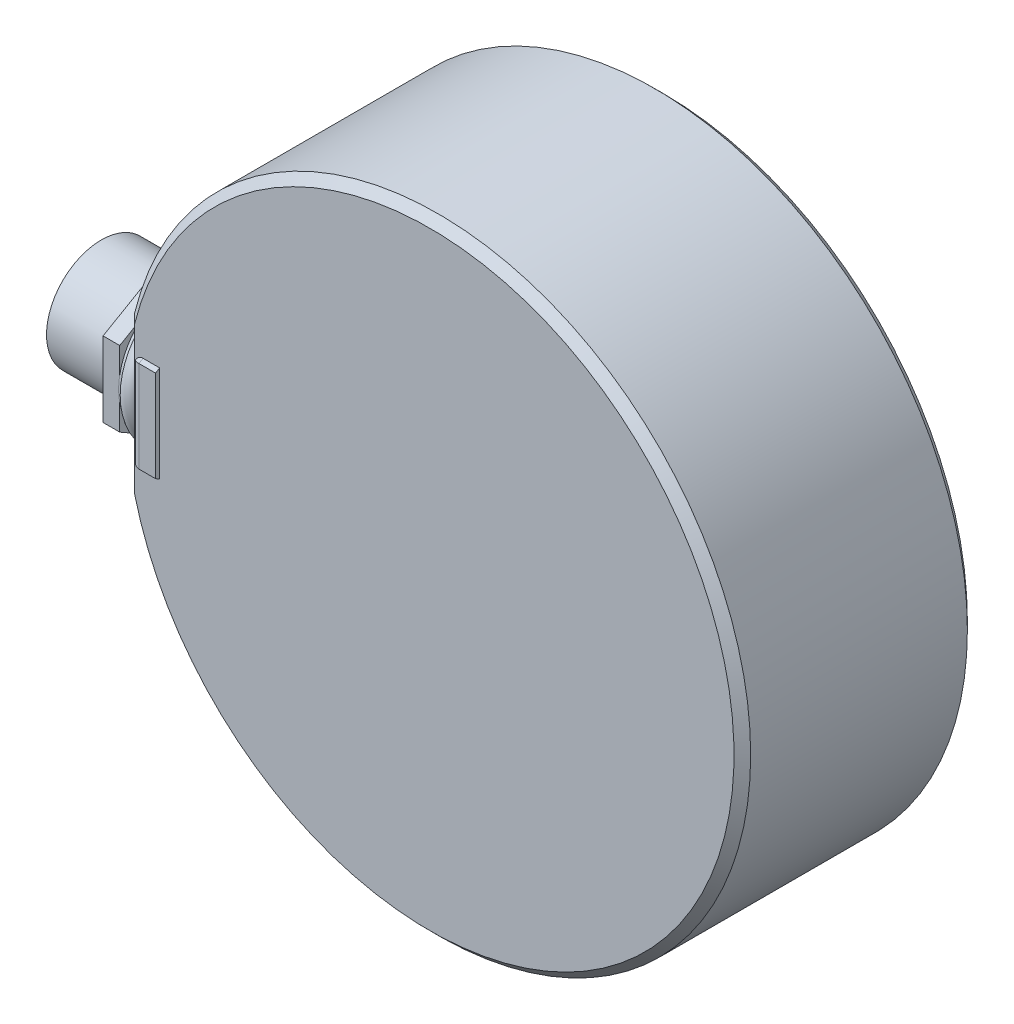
ISO-10303-21;
HEADER;
FILE_DESCRIPTION(('STEP AP214'),'2;1');
FILE_NAME('part.step','',(''),(''),'','','');
FILE_SCHEMA(('AUTOMOTIVE_DESIGN { 1 0 10303 214 1 1 1 1 }'));
ENDSEC;
DATA;
#1=APPLICATION_CONTEXT('core data for automotive mechanical design processes');
#2=APPLICATION_PROTOCOL_DEFINITION('international standard','automotive_design',2000,#1);
#3=PRODUCT_CONTEXT('',#1,'mechanical');
#4=PRODUCT('Part','Part','',(#3));
#5=PRODUCT_RELATED_PRODUCT_CATEGORY('part','',(#4));
#6=PRODUCT_DEFINITION_FORMATION('','',#4);
#7=PRODUCT_DEFINITION_CONTEXT('part definition',#1,'design');
#8=PRODUCT_DEFINITION('design','',#6,#7);
#9=PRODUCT_DEFINITION_SHAPE('','',#8);
#10=(LENGTH_UNIT() NAMED_UNIT(*) SI_UNIT(.MILLI.,.METRE.));
#11=(NAMED_UNIT(*) PLANE_ANGLE_UNIT() SI_UNIT($,.RADIAN.));
#12=(NAMED_UNIT(*) SI_UNIT($,.STERADIAN.) SOLID_ANGLE_UNIT());
#13=UNCERTAINTY_MEASURE_WITH_UNIT(LENGTH_MEASURE(1.E-05),#10,'distance_accuracy_value','');
#14=(GEOMETRIC_REPRESENTATION_CONTEXT(3) GLOBAL_UNCERTAINTY_ASSIGNED_CONTEXT((#13)) GLOBAL_UNIT_ASSIGNED_CONTEXT((#10,
#11,#12)) REPRESENTATION_CONTEXT('',''));
#15=CARTESIAN_POINT('',(0.,0.,0.));
#16=DIRECTION('',(0.,0.,1.));
#17=DIRECTION('',(1.,0.,0.));
#18=AXIS2_PLACEMENT_3D('',#15,#16,#17);
#19=CARTESIAN_POINT('',(-17.8663363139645,6.79129742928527,67.));
#20=DIRECTION('',(0.,0.,-1.));
#21=DIRECTION('',(-1.,0.,0.));
#22=AXIS2_PLACEMENT_3D('',#19,#20,#21);
#23=PLANE('',#22);
#24=CARTESIAN_POINT('',(-17.8663363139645,6.79129742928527,67.));
#25=DIRECTION('',(0.,0.,-1.));
#26=DIRECTION('',(-1.,0.,0.));
#27=AXIS2_PLACEMENT_3D('',#24,#25,#26);
#28=CIRCLE('',#27,15.75);
#29=CARTESIAN_POINT('',(-33.6163363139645,6.79129742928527,67.));
#30=VERTEX_POINT('',#29);
#31=EDGE_CURVE('P0_E269',#30,#30,#28,.T.);
#32=ORIENTED_EDGE('',*,*,#31,.T.);
#33=EDGE_LOOP('',(#32));
#34=FACE_BOUND('',#33,.T.);
#35=ADVANCED_FACE('P0_F18',(#34),#23,.T.);
#36=CARTESIAN_POINT('',(-17.8663363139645,6.79129742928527,67.5));
#37=DIRECTION('',(0.,0.,-1.));
#38=DIRECTION('',(-1.,0.,0.));
#39=AXIS2_PLACEMENT_3D('',#36,#37,#38);
#40=CYLINDRICAL_SURFACE('',#39,15.75);
#41=CARTESIAN_POINT('',(-17.8663363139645,6.79129742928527,62.0000000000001));
#42=DIRECTION('',(0.,0.,-1.));
#43=DIRECTION('',(-1.,0.,0.));
#44=AXIS2_PLACEMENT_3D('',#41,#42,#43);
#45=CIRCLE('',#44,15.75);
#46=CARTESIAN_POINT('',(-33.6163363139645,6.79129742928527,62.0000000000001));
#47=VERTEX_POINT('',#46);
#48=EDGE_CURVE('P0_E266',#47,#47,#45,.T.);
#49=ORIENTED_EDGE('',*,*,#48,.T.);
#50=EDGE_LOOP('',(#49));
#51=FACE_BOUND('',#50,.T.);
#52=ORIENTED_EDGE('',*,*,#31,.F.);
#53=EDGE_LOOP('',(#52));
#54=FACE_BOUND('',#53,.T.);
#55=ADVANCED_FACE('P0_F418',(#51,#54),#40,.F.);
#56=CARTESIAN_POINT('',(-42.8663363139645,6.79129742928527,71.0000000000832));
#57=DIRECTION('',(0.,0.,-1.));
#58=DIRECTION('',(-1.,0.,0.));
#59=AXIS2_PLACEMENT_3D('',#56,#57,#58);
#60=CONICAL_SURFACE('',#59,2.99999999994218,1.02974425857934);
#61=CARTESIAN_POINT('',(-42.8663363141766,6.79129742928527,72.8025818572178));
#62=VERTEX_POINT('',#61);
#63=VERTEX_LOOP('',#62);
#64=FACE_BOUND('',#63,.T.);
#65=CARTESIAN_POINT('',(-42.8663363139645,6.79129742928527,71.));
#66=DIRECTION('',(0.,0.,-1.));
#67=DIRECTION('',(-1.,0.,0.));
#68=AXIS2_PLACEMENT_3D('',#65,#66,#67);
#69=CIRCLE('',#68,3.);
#70=CARTESIAN_POINT('',(-45.8663363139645,6.79129742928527,71.));
#71=VERTEX_POINT('',#70);
#72=EDGE_CURVE('P0_E263',#71,#71,#69,.T.);
#73=ORIENTED_EDGE('',*,*,#72,.T.);
#74=EDGE_LOOP('',(#73));
#75=FACE_BOUND('',#74,.T.);
#76=ADVANCED_FACE('P0_F415',(#64,#75),#60,.F.);
#77=CARTESIAN_POINT('',(-35.5440058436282,24.468966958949,71.0000000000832));
#78=DIRECTION('',(0.,0.,-1.));
#79=DIRECTION('',(-1.,0.,0.));
#80=AXIS2_PLACEMENT_3D('',#77,#78,#79);
#81=CONICAL_SURFACE('',#80,3.24999999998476,1.02974425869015);
#82=CARTESIAN_POINT('',(-35.5440058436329,24.468966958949,72.9527970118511));
#83=VERTEX_POINT('',#82);
#84=VERTEX_LOOP('',#83);
#85=FACE_BOUND('',#84,.T.);
#86=CARTESIAN_POINT('',(-35.5440058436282,24.468966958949,71.));
#87=DIRECTION('',(0.,0.,-1.));
#88=DIRECTION('',(-1.,0.,0.));
#89=AXIS2_PLACEMENT_3D('',#86,#87,#88);
#90=CIRCLE('',#89,3.24999999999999);
#91=CARTESIAN_POINT('',(-38.7940058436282,24.468966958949,71.));
#92=VERTEX_POINT('',#91);
#93=EDGE_CURVE('P0_E260',#92,#92,#90,.T.);
#94=ORIENTED_EDGE('',*,*,#93,.T.);
#95=EDGE_LOOP('',(#94));
#96=FACE_BOUND('',#95,.T.);
#97=ADVANCED_FACE('P0_F411',(#85,#96),#81,.F.);
#98=CARTESIAN_POINT('',(-0.188666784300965,24.4689669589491,71.0000000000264));
#99=DIRECTION('',(0.,0.,-1.));
#100=DIRECTION('',(-1.,0.,0.));
#101=AXIS2_PLACEMENT_3D('',#98,#99,#100);
#102=CONICAL_SURFACE('',#101,3.24999999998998,1.0297442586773);
#103=CARTESIAN_POINT('',(-0.188666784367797,24.4689669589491,72.9527970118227));
#104=VERTEX_POINT('',#103);
#105=VERTEX_LOOP('',#104);
#106=FACE_BOUND('',#105,.T.);
#107=CARTESIAN_POINT('',(-0.188666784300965,24.4689669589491,71.));
#108=DIRECTION('',(0.,0.,-1.));
#109=DIRECTION('',(-1.,0.,0.));
#110=AXIS2_PLACEMENT_3D('',#107,#108,#109);
#111=CIRCLE('',#110,3.24999999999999);
#112=CARTESIAN_POINT('',(-3.43866678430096,24.4689669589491,71.));
#113=VERTEX_POINT('',#112);
#114=EDGE_CURVE('P0_E257',#113,#113,#111,.T.);
#115=ORIENTED_EDGE('',*,*,#114,.T.);
#116=EDGE_LOOP('',(#115));
#117=FACE_BOUND('',#116,.T.);
#118=ADVANCED_FACE('P0_F407',(#106,#117),#102,.F.);
#119=CARTESIAN_POINT('',(-0.188666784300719,-10.8863721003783,71.0000000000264));
#120=DIRECTION('',(0.,0.,-1.));
#121=DIRECTION('',(-1.,0.,0.));
#122=AXIS2_PLACEMENT_3D('',#119,#120,#121);
#123=CONICAL_SURFACE('',#122,3.24999999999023,1.0297442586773);
#124=CARTESIAN_POINT('',(-0.188666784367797,-10.8863721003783,72.9527970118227));
#125=VERTEX_POINT('',#124);
#126=VERTEX_LOOP('',#125);
#127=FACE_BOUND('',#126,.T.);
#128=CARTESIAN_POINT('',(-0.188666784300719,-10.8863721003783,71.));
#129=DIRECTION('',(0.,0.,-1.));
#130=DIRECTION('',(-1.,0.,0.));
#131=AXIS2_PLACEMENT_3D('',#128,#129,#130);
#132=CIRCLE('',#131,3.24999999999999);
#133=CARTESIAN_POINT('',(-3.43866678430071,-10.8863721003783,71.));
#134=VERTEX_POINT('',#133);
#135=EDGE_CURVE('P0_E254',#134,#134,#132,.T.);
#136=ORIENTED_EDGE('',*,*,#135,.T.);
#137=EDGE_LOOP('',(#136));
#138=FACE_BOUND('',#137,.T.);
#139=ADVANCED_FACE('P0_F403',(#127,#138),#123,.F.);
#140=CARTESIAN_POINT('',(-35.5440058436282,-10.8863721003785,71.0000000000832));
#141=DIRECTION('',(0.,0.,-1.));
#142=DIRECTION('',(-1.,0.,0.));
#143=AXIS2_PLACEMENT_3D('',#140,#141,#142);
#144=CONICAL_SURFACE('',#143,3.24999999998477,1.02974425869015);
#145=CARTESIAN_POINT('',(-35.5440058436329,-10.8863721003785,72.9527970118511));
#146=VERTEX_POINT('',#145);
#147=VERTEX_LOOP('',#146);
#148=FACE_BOUND('',#147,.T.);
#149=CARTESIAN_POINT('',(-35.5440058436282,-10.8863721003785,71.));
#150=DIRECTION('',(0.,0.,-1.));
#151=DIRECTION('',(-1.,0.,0.));
#152=AXIS2_PLACEMENT_3D('',#149,#150,#151);
#153=CIRCLE('',#152,3.24999999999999);
#154=CARTESIAN_POINT('',(-38.7940058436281,-10.8863721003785,71.));
#155=VERTEX_POINT('',#154);
#156=EDGE_CURVE('P0_E251',#155,#155,#153,.T.);
#157=ORIENTED_EDGE('',*,*,#156,.T.);
#158=EDGE_LOOP('',(#157));
#159=FACE_BOUND('',#158,.T.);
#160=ADVANCED_FACE('P0_F399',(#148,#159),#144,.F.);
#161=CARTESIAN_POINT('',(-17.8663363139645,38.2912974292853,70.9999999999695));
#162=DIRECTION('',(0.,0.,-1.));
#163=DIRECTION('',(-1.,0.,0.));
#164=AXIS2_PLACEMENT_3D('',#161,#162,#163);
#165=CONICAL_SURFACE('',#164,3.25000000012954,1.02974425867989);
#166=CARTESIAN_POINT('',(-17.8663363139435,38.2912974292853,72.9527970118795));
#167=VERTEX_POINT('',#166);
#168=VERTEX_LOOP('',#167);
#169=FACE_BOUND('',#168,.T.);
#170=CARTESIAN_POINT('',(-17.8663363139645,38.2912974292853,71.));
#171=DIRECTION('',(0.,0.,-1.));
#172=DIRECTION('',(-1.,0.,0.));
#173=AXIS2_PLACEMENT_3D('',#170,#171,#172);
#174=CIRCLE('',#173,3.25);
#175=CARTESIAN_POINT('',(-21.1163363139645,38.2912974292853,71.));
#176=VERTEX_POINT('',#175);
#177=EDGE_CURVE('P0_E248',#176,#176,#174,.T.);
#178=ORIENTED_EDGE('',*,*,#177,.T.);
#179=EDGE_LOOP('',(#178));
#180=FACE_BOUND('',#179,.T.);
#181=ADVANCED_FACE('P0_F395',(#169,#180),#165,.F.);
#182=CARTESIAN_POINT('',(-17.8663363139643,-24.7087025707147,70.9999999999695));
#183=DIRECTION('',(0.,0.,-1.));
#184=DIRECTION('',(-1.,0.,0.));
#185=AXIS2_PLACEMENT_3D('',#182,#183,#184);
#186=CONICAL_SURFACE('',#185,3.25000000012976,1.02974425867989);
#187=CARTESIAN_POINT('',(-17.8663363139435,-24.7087025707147,72.9527970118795));
#188=VERTEX_POINT('',#187);
#189=VERTEX_LOOP('',#188);
#190=FACE_BOUND('',#189,.T.);
#191=CARTESIAN_POINT('',(-17.8663363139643,-24.7087025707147,71.));
#192=DIRECTION('',(0.,0.,-1.));
#193=DIRECTION('',(-1.,0.,0.));
#194=AXIS2_PLACEMENT_3D('',#191,#192,#193);
#195=CIRCLE('',#194,3.25);
#196=CARTESIAN_POINT('',(-21.1163363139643,-24.7087025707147,71.));
#197=VERTEX_POINT('',#196);
#198=EDGE_CURVE('P0_E244',#197,#197,#195,.T.);
#199=ORIENTED_EDGE('',*,*,#198,.T.);
#200=EDGE_LOOP('',(#199));
#201=FACE_BOUND('',#200,.T.);
#202=ADVANCED_FACE('P0_F391',(#190,#201),#186,.F.);
#203=CARTESIAN_POINT('',(-17.8663363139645,6.79129742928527,61.));
#204=DIRECTION('',(0.,0.,-1.));
#205=DIRECTION('',(0.,1.,0.));
#206=AXIS2_PLACEMENT_3D('',#203,#204,#205);
#207=CONICAL_SURFACE('',#206,16.7500000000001,0.785398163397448);
#208=CARTESIAN_POINT('',(-17.8663363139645,6.79129742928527,61.));
#209=DIRECTION('',(0.,0.,-1.));
#210=DIRECTION('',(0.,1.,0.));
#211=AXIS2_PLACEMENT_3D('',#208,#209,#210);
#212=CIRCLE('',#211,16.7500000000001);
#213=CARTESIAN_POINT('',(-17.8663363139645,23.5412974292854,61.));
#214=VERTEX_POINT('',#213);
#215=EDGE_CURVE('P0_E247',#214,#214,#212,.T.);
#216=ORIENTED_EDGE('',*,*,#215,.T.);
#217=EDGE_LOOP('',(#216));
#218=FACE_BOUND('',#217,.T.);
#219=ORIENTED_EDGE('',*,*,#48,.F.);
#220=EDGE_LOOP('',(#219));
#221=FACE_BOUND('',#220,.T.);
#222=ADVANCED_FACE('P0_F387',(#218,#221),#207,.F.);
#223=CARTESIAN_POINT('',(-42.8663363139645,6.79129742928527,61.));
#224=DIRECTION('',(0.,0.,-1.));
#225=DIRECTION('',(-1.,0.,0.));
#226=AXIS2_PLACEMENT_3D('',#223,#224,#225);
#227=CYLINDRICAL_SURFACE('',#226,3.);
#228=ORIENTED_EDGE('',*,*,#72,.F.);
#229=EDGE_LOOP('',(#228));
#230=FACE_BOUND('',#229,.T.);
#231=CARTESIAN_POINT('',(-42.8663363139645,6.79129742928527,61.));
#232=DIRECTION('',(0.,0.,-1.));
#233=DIRECTION('',(-1.,0.,0.));
#234=AXIS2_PLACEMENT_3D('',#231,#232,#233);
#235=CIRCLE('',#234,3.);
#236=CARTESIAN_POINT('',(-45.8663363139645,6.79129742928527,61.));
#237=VERTEX_POINT('',#236);
#238=EDGE_CURVE('P0_E754',#237,#237,#235,.T.);
#239=ORIENTED_EDGE('',*,*,#238,.T.);
#240=EDGE_LOOP('',(#239));
#241=FACE_BOUND('',#240,.T.);
#242=ADVANCED_FACE('P0_F383',(#230,#241),#227,.F.);
#243=CARTESIAN_POINT('',(-35.5440058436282,24.468966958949,61.));
#244=DIRECTION('',(0.,0.,-1.));
#245=DIRECTION('',(-1.,0.,0.));
#246=AXIS2_PLACEMENT_3D('',#243,#244,#245);
#247=CYLINDRICAL_SURFACE('',#246,3.24999999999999);
#248=ORIENTED_EDGE('',*,*,#93,.F.);
#249=EDGE_LOOP('',(#248));
#250=FACE_BOUND('',#249,.T.);
#251=CARTESIAN_POINT('',(-35.5440058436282,24.468966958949,61.));
#252=DIRECTION('',(0.,0.,-1.));
#253=DIRECTION('',(-1.,0.,0.));
#254=AXIS2_PLACEMENT_3D('',#251,#252,#253);
#255=CIRCLE('',#254,3.24999999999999);
#256=CARTESIAN_POINT('',(-38.7940058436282,24.468966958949,61.));
#257=VERTEX_POINT('',#256);
#258=EDGE_CURVE('P0_E757',#257,#257,#255,.T.);
#259=ORIENTED_EDGE('',*,*,#258,.T.);
#260=EDGE_LOOP('',(#259));
#261=FACE_BOUND('',#260,.T.);
#262=ADVANCED_FACE('P0_F379',(#250,#261),#247,.F.);
#263=CARTESIAN_POINT('',(-0.188666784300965,24.4689669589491,61.));
#264=DIRECTION('',(0.,0.,-1.));
#265=DIRECTION('',(-1.,0.,0.));
#266=AXIS2_PLACEMENT_3D('',#263,#264,#265);
#267=CYLINDRICAL_SURFACE('',#266,3.24999999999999);
#268=ORIENTED_EDGE('',*,*,#114,.F.);
#269=EDGE_LOOP('',(#268));
#270=FACE_BOUND('',#269,.T.);
#271=CARTESIAN_POINT('',(-0.188666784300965,24.4689669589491,61.));
#272=DIRECTION('',(0.,0.,-1.));
#273=DIRECTION('',(-1.,0.,0.));
#274=AXIS2_PLACEMENT_3D('',#271,#272,#273);
#275=CIRCLE('',#274,3.24999999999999);
#276=CARTESIAN_POINT('',(-3.43866678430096,24.4689669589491,61.));
#277=VERTEX_POINT('',#276);
#278=EDGE_CURVE('P0_E760',#277,#277,#275,.T.);
#279=ORIENTED_EDGE('',*,*,#278,.T.);
#280=EDGE_LOOP('',(#279));
#281=FACE_BOUND('',#280,.T.);
#282=ADVANCED_FACE('P0_F375',(#270,#281),#267,.F.);
#283=CARTESIAN_POINT('',(-0.188666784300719,-10.8863721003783,61.));
#284=DIRECTION('',(0.,0.,-1.));
#285=DIRECTION('',(-1.,0.,0.));
#286=AXIS2_PLACEMENT_3D('',#283,#284,#285);
#287=CYLINDRICAL_SURFACE('',#286,3.24999999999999);
#288=ORIENTED_EDGE('',*,*,#135,.F.);
#289=EDGE_LOOP('',(#288));
#290=FACE_BOUND('',#289,.T.);
#291=CARTESIAN_POINT('',(-0.188666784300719,-10.8863721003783,61.));
#292=DIRECTION('',(0.,0.,-1.));
#293=DIRECTION('',(-1.,0.,0.));
#294=AXIS2_PLACEMENT_3D('',#291,#292,#293);
#295=CIRCLE('',#294,3.24999999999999);
#296=CARTESIAN_POINT('',(-3.43866678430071,-10.8863721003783,61.));
#297=VERTEX_POINT('',#296);
#298=EDGE_CURVE('P0_E763',#297,#297,#295,.T.);
#299=ORIENTED_EDGE('',*,*,#298,.T.);
#300=EDGE_LOOP('',(#299));
#301=FACE_BOUND('',#300,.T.);
#302=ADVANCED_FACE('P0_F371',(#290,#301),#287,.F.);
#303=CARTESIAN_POINT('',(-35.5440058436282,-10.8863721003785,61.));
#304=DIRECTION('',(0.,0.,-1.));
#305=DIRECTION('',(-1.,0.,0.));
#306=AXIS2_PLACEMENT_3D('',#303,#304,#305);
#307=CYLINDRICAL_SURFACE('',#306,3.24999999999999);
#308=ORIENTED_EDGE('',*,*,#156,.F.);
#309=EDGE_LOOP('',(#308));
#310=FACE_BOUND('',#309,.T.);
#311=CARTESIAN_POINT('',(-35.5440058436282,-10.8863721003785,61.));
#312=DIRECTION('',(0.,0.,-1.));
#313=DIRECTION('',(-1.,0.,0.));
#314=AXIS2_PLACEMENT_3D('',#311,#312,#313);
#315=CIRCLE('',#314,3.24999999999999);
#316=CARTESIAN_POINT('',(-38.7940058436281,-10.8863721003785,61.));
#317=VERTEX_POINT('',#316);
#318=EDGE_CURVE('P0_E766',#317,#317,#315,.T.);
#319=ORIENTED_EDGE('',*,*,#318,.T.);
#320=EDGE_LOOP('',(#319));
#321=FACE_BOUND('',#320,.T.);
#322=ADVANCED_FACE('P0_F367',(#310,#321),#307,.F.);
#323=CARTESIAN_POINT('',(-17.8663363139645,38.2912974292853,61.));
#324=DIRECTION('',(0.,0.,-1.));
#325=DIRECTION('',(-1.,0.,0.));
#326=AXIS2_PLACEMENT_3D('',#323,#324,#325);
#327=CYLINDRICAL_SURFACE('',#326,3.25);
#328=ORIENTED_EDGE('',*,*,#177,.F.);
#329=EDGE_LOOP('',(#328));
#330=FACE_BOUND('',#329,.T.);
#331=CARTESIAN_POINT('',(-17.8663363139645,38.2912974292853,61.));
#332=DIRECTION('',(0.,0.,-1.));
#333=DIRECTION('',(-1.,0.,0.));
#334=AXIS2_PLACEMENT_3D('',#331,#332,#333);
#335=CIRCLE('',#334,3.25);
#336=CARTESIAN_POINT('',(-21.1163363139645,38.2912974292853,61.));
#337=VERTEX_POINT('',#336);
#338=EDGE_CURVE('P0_E769',#337,#337,#335,.T.);
#339=ORIENTED_EDGE('',*,*,#338,.T.);
#340=EDGE_LOOP('',(#339));
#341=FACE_BOUND('',#340,.T.);
#342=ADVANCED_FACE('P0_F363',(#330,#341),#327,.F.);
#343=CARTESIAN_POINT('',(-17.8663363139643,-24.7087025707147,61.));
#344=DIRECTION('',(0.,0.,-1.));
#345=DIRECTION('',(-1.,0.,0.));
#346=AXIS2_PLACEMENT_3D('',#343,#344,#345);
#347=CYLINDRICAL_SURFACE('',#346,3.25);
#348=ORIENTED_EDGE('',*,*,#198,.F.);
#349=EDGE_LOOP('',(#348));
#350=FACE_BOUND('',#349,.T.);
#351=CARTESIAN_POINT('',(-17.8663363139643,-24.7087025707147,61.));
#352=DIRECTION('',(0.,0.,-1.));
#353=DIRECTION('',(-1.,0.,0.));
#354=AXIS2_PLACEMENT_3D('',#351,#352,#353);
#355=CIRCLE('',#354,3.25);
#356=CARTESIAN_POINT('',(-21.1163363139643,-24.7087025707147,61.));
#357=VERTEX_POINT('',#356);
#358=EDGE_CURVE('P0_E772',#357,#357,#355,.T.);
#359=ORIENTED_EDGE('',*,*,#358,.T.);
#360=EDGE_LOOP('',(#359));
#361=FACE_BOUND('',#360,.T.);
#362=ADVANCED_FACE('P0_F359',(#350,#361),#347,.F.);
#363=CARTESIAN_POINT('',(-17.8663363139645,6.79129742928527,61.));
#364=DIRECTION('',(0.,0.,1.));
#365=DIRECTION('',(1.,0.,0.));
#366=AXIS2_PLACEMENT_3D('',#363,#364,#365);
#367=PLANE('',#366);
#368=ORIENTED_EDGE('',*,*,#358,.F.);
#369=EDGE_LOOP('',(#368));
#370=FACE_BOUND('',#369,.T.);
#371=ORIENTED_EDGE('',*,*,#338,.F.);
#372=EDGE_LOOP('',(#371));
#373=FACE_BOUND('',#372,.T.);
#374=ORIENTED_EDGE('',*,*,#318,.F.);
#375=EDGE_LOOP('',(#374));
#376=FACE_BOUND('',#375,.T.);
#377=ORIENTED_EDGE('',*,*,#298,.F.);
#378=EDGE_LOOP('',(#377));
#379=FACE_BOUND('',#378,.T.);
#380=ORIENTED_EDGE('',*,*,#278,.F.);
#381=EDGE_LOOP('',(#380));
#382=FACE_BOUND('',#381,.T.);
#383=ORIENTED_EDGE('',*,*,#258,.F.);
#384=EDGE_LOOP('',(#383));
#385=FACE_BOUND('',#384,.T.);
#386=ORIENTED_EDGE('',*,*,#238,.F.);
#387=EDGE_LOOP('',(#386));
#388=FACE_BOUND('',#387,.T.);
#389=ORIENTED_EDGE('',*,*,#215,.F.);
#390=EDGE_LOOP('',(#389));
#391=FACE_BOUND('',#390,.T.);
#392=CARTESIAN_POINT('',(-17.8663363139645,6.79129742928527,61.));
#393=DIRECTION('',(0.,0.,1.));
#394=DIRECTION('',(1.,0.,0.));
#395=AXIS2_PLACEMENT_3D('',#392,#393,#394);
#396=CIRCLE('',#395,36.5);
#397=CARTESIAN_POINT('',(18.6336636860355,6.79129742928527,61.));
#398=VERTEX_POINT('',#397);
#399=EDGE_CURVE('P0_E775',#398,#398,#396,.T.);
#400=ORIENTED_EDGE('',*,*,#399,.F.);
#401=EDGE_LOOP('',(#400));
#402=FACE_BOUND('',#401,.T.);
#403=ADVANCED_FACE('P0_F355',(#370,#373,#376,#379,#382,#385,#388,#391,#402),#367,.F.);
#404=CARTESIAN_POINT('',(-53.2703196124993,15.6686825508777,-29.465520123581));
#405=DIRECTION('',(-1.,0.,0.));
#406=DIRECTION('',(0.,0.,1.));
#407=AXIS2_PLACEMENT_3D('',#404,#405,#406);
#408=PLANE('',#407);
#409=CARTESIAN_POINT('',(-53.2703196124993,3.02831988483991,74.7));
#410=DIRECTION('',(-1.,0.,0.));
#411=DIRECTION('',(0.,0.,1.));
#412=AXIS2_PLACEMENT_3D('',#409,#410,#411);
#413=CIRCLE('',#412,1.5);
#414=CARTESIAN_POINT('',(-53.2703196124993,3.02831988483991,73.2));
#415=VERTEX_POINT('',#414);
#416=CARTESIAN_POINT('',(-53.2703196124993,2.15994045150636,73.4769230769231));
#417=VERTEX_POINT('',#416);
#418=EDGE_CURVE('P0_E215',#415,#417,#413,.T.);
#419=ORIENTED_EDGE('',*,*,#418,.T.);
#420=CARTESIAN_POINT('',(-53.2703196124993,6.79129742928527,80.));
#421=DIRECTION('',(-1.,0.,0.));
#422=DIRECTION('',(0.,0.,1.));
#423=AXIS2_PLACEMENT_3D('',#420,#421,#422);
#424=CIRCLE('',#423,8.00000000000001);
#425=CARTESIAN_POINT('',(-53.2703196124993,2.15994045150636,86.5230769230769));
#426=VERTEX_POINT('',#425);
#427=EDGE_CURVE('P0_E211',#417,#426,#424,.T.);
#428=ORIENTED_EDGE('',*,*,#427,.T.);
#429=CARTESIAN_POINT('',(-53.2703196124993,3.02831988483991,85.3));
#430=DIRECTION('',(-1.,0.,0.));
#431=DIRECTION('',(0.,0.,1.));
#432=AXIS2_PLACEMENT_3D('',#429,#430,#431);
#433=CIRCLE('',#432,1.5);
#434=CARTESIAN_POINT('',(-53.2703196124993,3.02831988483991,86.8));
#435=VERTEX_POINT('',#434);
#436=EDGE_CURVE('P0_E239',#426,#435,#433,.T.);
#437=ORIENTED_EDGE('',*,*,#436,.T.);
#438=DIRECTION('',(0.,1.,0.));
#439=VECTOR('',#438,1.);
#440=CARTESIAN_POINT('',(-53.2703196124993,11.0055589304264,86.8));
#441=LINE('',#440,#439);
#442=CARTESIAN_POINT('',(-53.2703196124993,10.5542749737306,86.8));
#443=VERTEX_POINT('',#442);
#444=EDGE_CURVE('P0_E235',#435,#443,#441,.T.);
#445=ORIENTED_EDGE('',*,*,#444,.T.);
#446=CARTESIAN_POINT('',(-53.2703196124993,10.5542749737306,85.3));
#447=DIRECTION('',(-1.,0.,0.));
#448=DIRECTION('',(0.,0.,1.));
#449=AXIS2_PLACEMENT_3D('',#446,#447,#448);
#450=CIRCLE('',#449,1.5);
#451=CARTESIAN_POINT('',(-53.2703196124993,11.4226544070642,86.5230769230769));
#452=VERTEX_POINT('',#451);
#453=EDGE_CURVE('P0_E231',#443,#452,#450,.T.);
#454=ORIENTED_EDGE('',*,*,#453,.T.);
#455=CARTESIAN_POINT('',(-53.2703196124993,6.79129742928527,80.));
#456=DIRECTION('',(-1.,0.,0.));
#457=DIRECTION('',(0.,0.,1.));
#458=AXIS2_PLACEMENT_3D('',#455,#456,#457);
#459=CIRCLE('',#458,8.00000000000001);
#460=CARTESIAN_POINT('',(-53.2703196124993,11.4226544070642,73.4769230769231));
#461=VERTEX_POINT('',#460);
#462=EDGE_CURVE('P0_E227',#452,#461,#459,.T.);
#463=ORIENTED_EDGE('',*,*,#462,.T.);
#464=CARTESIAN_POINT('',(-53.2703196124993,10.5542749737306,74.7));
#465=DIRECTION('',(-1.,0.,0.));
#466=DIRECTION('',(0.,0.,1.));
#467=AXIS2_PLACEMENT_3D('',#464,#465,#466);
#468=CIRCLE('',#467,1.5);
#469=CARTESIAN_POINT('',(-53.2703196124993,10.5542749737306,73.2));
#470=VERTEX_POINT('',#469);
#471=EDGE_CURVE('P0_E223',#461,#470,#468,.T.);
#472=ORIENTED_EDGE('',*,*,#471,.T.);
#473=DIRECTION('',(0.,1.,0.));
#474=VECTOR('',#473,1.);
#475=CARTESIAN_POINT('',(-53.2703196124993,11.0055589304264,73.2));
#476=LINE('',#475,#474);
#477=EDGE_CURVE('P0_E219',#470,#415,#476,.F.);
#478=ORIENTED_EDGE('',*,*,#477,.T.);
#479=EDGE_LOOP('',(#419,#428,#437,#445,#454,#463,#472,#478));
#480=FACE_BOUND('',#479,.T.);
#481=ADVANCED_FACE('P0_F351',(#480),#408,.T.);
#482=CARTESIAN_POINT('',(-17.8663363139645,6.79129742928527,62.));
#483=DIRECTION('',(0.,0.,1.));
#484=DIRECTION('',(1.,0.,0.));
#485=AXIS2_PLACEMENT_3D('',#482,#483,#484);
#486=CONICAL_SURFACE('',#485,37.5,0.785398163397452);
#487=CARTESIAN_POINT('',(-17.8663363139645,6.79129742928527,62.));
#488=DIRECTION('',(0.,0.,-1.));
#489=DIRECTION('',(-1.,0.,0.));
#490=AXIS2_PLACEMENT_3D('',#487,#488,#489);
#491=CIRCLE('',#490,37.5);
#492=CARTESIAN_POINT('',(-55.3663363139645,6.79129742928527,62.));
#493=VERTEX_POINT('',#492);
#494=EDGE_CURVE('P0_E205',#493,#493,#491,.F.);
#495=ORIENTED_EDGE('',*,*,#494,.F.);
#496=EDGE_LOOP('',(#495));
#497=FACE_BOUND('',#496,.T.);
#498=ORIENTED_EDGE('',*,*,#399,.T.);
#499=EDGE_LOOP('',(#498));
#500=FACE_BOUND('',#499,.T.);
#501=ADVANCED_FACE('P0_F347',(#497,#500),#486,.T.);
#502=CARTESIAN_POINT('',(19.6346636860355,3.02831988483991,85.3));
#503=DIRECTION('',(-1.,0.,0.));
#504=DIRECTION('',(0.,0.,1.));
#505=AXIS2_PLACEMENT_3D('',#502,#503,#504);
#506=CYLINDRICAL_SURFACE('',#505,1.5);
#507=ORIENTED_EDGE('',*,*,#436,.F.);
#508=DIRECTION('',(-1.,0.,0.));
#509=VECTOR('',#508,1.);
#510=CARTESIAN_POINT('',(19.6346636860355,2.15994045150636,86.5230769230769));
#511=LINE('',#510,#509);
#512=CARTESIAN_POINT('',(-54.2703196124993,2.15994045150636,86.5230769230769));
#513=VERTEX_POINT('',#512);
#514=EDGE_CURVE('P0_E208',#426,#513,#511,.T.);
#515=ORIENTED_EDGE('',*,*,#514,.T.);
#516=CARTESIAN_POINT('',(-54.2703196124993,3.02831988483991,85.3));
#517=DIRECTION('',(-1.,0.,0.));
#518=DIRECTION('',(0.,0.,1.));
#519=AXIS2_PLACEMENT_3D('',#516,#517,#518);
#520=CIRCLE('',#519,1.5);
#521=CARTESIAN_POINT('',(-54.2703196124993,3.02831988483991,86.8));
#522=VERTEX_POINT('',#521);
#523=EDGE_CURVE('P0_E194',#513,#522,#520,.T.);
#524=ORIENTED_EDGE('',*,*,#523,.T.);
#525=DIRECTION('',(1.,0.,0.));
#526=VECTOR('',#525,1.);
#527=CARTESIAN_POINT('',(19.6346636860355,3.02831988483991,86.8));
#528=LINE('',#527,#526);
#529=EDGE_CURVE('P0_E236',#522,#435,#528,.T.);
#530=ORIENTED_EDGE('',*,*,#529,.T.);
#531=EDGE_LOOP('',(#507,#515,#524,#530));
#532=FACE_BOUND('',#531,.T.);
#533=ADVANCED_FACE('P0_F343',(#532),#506,.F.);
#534=CARTESIAN_POINT('',(19.6346636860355,11.0055589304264,86.8));
#535=DIRECTION('',(0.,0.,1.));
#536=DIRECTION('',(1.,0.,0.));
#537=AXIS2_PLACEMENT_3D('',#534,#535,#536);
#538=PLANE('',#537);
#539=ORIENTED_EDGE('',*,*,#444,.F.);
#540=ORIENTED_EDGE('',*,*,#529,.F.);
#541=DIRECTION('',(0.,1.,0.));
#542=VECTOR('',#541,1.);
#543=CARTESIAN_POINT('',(-54.2703196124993,15.7912974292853,86.8));
#544=LINE('',#543,#542);
#545=CARTESIAN_POINT('',(-54.2703196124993,10.5542749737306,86.8));
#546=VERTEX_POINT('',#545);
#547=EDGE_CURVE('P0_E191',#522,#546,#544,.T.);
#548=ORIENTED_EDGE('',*,*,#547,.T.);
#549=DIRECTION('',(-1.,0.,0.));
#550=VECTOR('',#549,1.);
#551=CARTESIAN_POINT('',(19.6346636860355,10.5542749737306,86.8));
#552=LINE('',#551,#550);
#553=EDGE_CURVE('P0_E232',#546,#443,#552,.F.);
#554=ORIENTED_EDGE('',*,*,#553,.T.);
#555=EDGE_LOOP('',(#539,#540,#548,#554));
#556=FACE_BOUND('',#555,.T.);
#557=ADVANCED_FACE('P0_F339',(#556),#538,.F.);
#558=CARTESIAN_POINT('',(19.6346636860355,10.5542749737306,85.3));
#559=DIRECTION('',(-1.,0.,0.));
#560=DIRECTION('',(0.,0.,1.));
#561=AXIS2_PLACEMENT_3D('',#558,#559,#560);
#562=CYLINDRICAL_SURFACE('',#561,1.5);
#563=ORIENTED_EDGE('',*,*,#453,.F.);
#564=ORIENTED_EDGE('',*,*,#553,.F.);
#565=CARTESIAN_POINT('',(-54.2703196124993,10.5542749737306,85.3));
#566=DIRECTION('',(-1.,0.,0.));
#567=DIRECTION('',(0.,0.,1.));
#568=AXIS2_PLACEMENT_3D('',#565,#566,#567);
#569=CIRCLE('',#568,1.5);
#570=CARTESIAN_POINT('',(-54.2703196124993,11.4226544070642,86.5230769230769));
#571=VERTEX_POINT('',#570);
#572=EDGE_CURVE('P0_E193',#546,#571,#569,.T.);
#573=ORIENTED_EDGE('',*,*,#572,.T.);
#574=DIRECTION('',(-1.,0.,0.));
#575=VECTOR('',#574,1.);
#576=CARTESIAN_POINT('',(19.6346636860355,11.4226544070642,86.5230769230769));
#577=LINE('',#576,#575);
#578=EDGE_CURVE('P0_E228',#571,#452,#577,.F.);
#579=ORIENTED_EDGE('',*,*,#578,.T.);
#580=EDGE_LOOP('',(#563,#564,#573,#579));
#581=FACE_BOUND('',#580,.T.);
#582=ADVANCED_FACE('P0_F335',(#581),#562,.F.);
#583=CARTESIAN_POINT('',(19.6346636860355,6.79129742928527,80.));
#584=DIRECTION('',(-1.,0.,0.));
#585=DIRECTION('',(0.,0.,1.));
#586=AXIS2_PLACEMENT_3D('',#583,#584,#585);
#587=CYLINDRICAL_SURFACE('',#586,8.00000000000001);
#588=ORIENTED_EDGE('',*,*,#462,.F.);
#589=ORIENTED_EDGE('',*,*,#578,.F.);
#590=CARTESIAN_POINT('',(-54.2703196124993,6.79129742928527,80.));
#591=DIRECTION('',(-1.,0.,0.));
#592=DIRECTION('',(0.,0.,1.));
#593=AXIS2_PLACEMENT_3D('',#590,#591,#592);
#594=CIRCLE('',#593,8.00000000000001);
#595=CARTESIAN_POINT('',(-54.2703196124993,11.4226544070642,73.4769230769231));
#596=VERTEX_POINT('',#595);
#597=EDGE_CURVE('P0_E788',#571,#596,#594,.T.);
#598=ORIENTED_EDGE('',*,*,#597,.T.);
#599=DIRECTION('',(-1.,0.,0.));
#600=VECTOR('',#599,1.);
#601=CARTESIAN_POINT('',(19.6346636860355,11.4226544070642,73.4769230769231));
#602=LINE('',#601,#600);
#603=EDGE_CURVE('P0_E224',#596,#461,#602,.F.);
#604=ORIENTED_EDGE('',*,*,#603,.T.);
#605=EDGE_LOOP('',(#588,#589,#598,#604));
#606=FACE_BOUND('',#605,.T.);
#607=ADVANCED_FACE('P0_F331',(#606),#587,.F.);
#608=CARTESIAN_POINT('',(19.6346636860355,10.5542749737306,74.7));
#609=DIRECTION('',(-1.,0.,0.));
#610=DIRECTION('',(0.,0.,1.));
#611=AXIS2_PLACEMENT_3D('',#608,#609,#610);
#612=CYLINDRICAL_SURFACE('',#611,1.5);
#613=ORIENTED_EDGE('',*,*,#471,.F.);
#614=ORIENTED_EDGE('',*,*,#603,.F.);
#615=CARTESIAN_POINT('',(-54.2703196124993,10.5542749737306,74.7));
#616=DIRECTION('',(-1.,0.,0.));
#617=DIRECTION('',(0.,0.,1.));
#618=AXIS2_PLACEMENT_3D('',#615,#616,#617);
#619=CIRCLE('',#618,1.5);
#620=CARTESIAN_POINT('',(-54.2703196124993,10.5542749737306,73.2));
#621=VERTEX_POINT('',#620);
#622=EDGE_CURVE('P0_E190',#596,#621,#619,.T.);
#623=ORIENTED_EDGE('',*,*,#622,.T.);
#624=DIRECTION('',(-1.,0.,0.));
#625=VECTOR('',#624,1.);
#626=CARTESIAN_POINT('',(19.6346636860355,10.5542749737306,73.2));
#627=LINE('',#626,#625);
#628=EDGE_CURVE('P0_E220',#621,#470,#627,.F.);
#629=ORIENTED_EDGE('',*,*,#628,.T.);
#630=EDGE_LOOP('',(#613,#614,#623,#629));
#631=FACE_BOUND('',#630,.T.);
#632=ADVANCED_FACE('P0_F327',(#631),#612,.F.);
#633=CARTESIAN_POINT('',(19.6346636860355,11.0055589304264,73.2));
#634=DIRECTION('',(0.,0.,-1.));
#635=DIRECTION('',(-1.,0.,0.));
#636=AXIS2_PLACEMENT_3D('',#633,#634,#635);
#637=PLANE('',#636);
#638=ORIENTED_EDGE('',*,*,#477,.F.);
#639=ORIENTED_EDGE('',*,*,#628,.F.);
#640=DIRECTION('',(0.,1.,0.));
#641=VECTOR('',#640,1.);
#642=CARTESIAN_POINT('',(-54.2703196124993,15.7912974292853,73.2));
#643=LINE('',#642,#641);
#644=CARTESIAN_POINT('',(-54.2703196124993,3.02831988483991,73.2));
#645=VERTEX_POINT('',#644);
#646=EDGE_CURVE('P0_E187',#621,#645,#643,.F.);
#647=ORIENTED_EDGE('',*,*,#646,.T.);
#648=DIRECTION('',(-1.,0.,0.));
#649=VECTOR('',#648,1.);
#650=CARTESIAN_POINT('',(19.6346636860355,3.02831988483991,73.2));
#651=LINE('',#650,#649);
#652=EDGE_CURVE('P0_E216',#645,#415,#651,.F.);
#653=ORIENTED_EDGE('',*,*,#652,.T.);
#654=EDGE_LOOP('',(#638,#639,#647,#653));
#655=FACE_BOUND('',#654,.T.);
#656=ADVANCED_FACE('P0_F323',(#655),#637,.F.);
#657=CARTESIAN_POINT('',(19.6346636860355,3.02831988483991,74.7));
#658=DIRECTION('',(-1.,0.,0.));
#659=DIRECTION('',(0.,0.,1.));
#660=AXIS2_PLACEMENT_3D('',#657,#658,#659);
#661=CYLINDRICAL_SURFACE('',#660,1.5);
#662=ORIENTED_EDGE('',*,*,#418,.F.);
#663=ORIENTED_EDGE('',*,*,#652,.F.);
#664=CARTESIAN_POINT('',(-54.2703196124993,3.02831988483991,74.7));
#665=DIRECTION('',(-1.,0.,0.));
#666=DIRECTION('',(0.,0.,1.));
#667=AXIS2_PLACEMENT_3D('',#664,#665,#666);
#668=CIRCLE('',#667,1.5);
#669=CARTESIAN_POINT('',(-54.2703196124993,2.15994045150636,73.4769230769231));
#670=VERTEX_POINT('',#669);
#671=EDGE_CURVE('P0_E189',#645,#670,#668,.T.);
#672=ORIENTED_EDGE('',*,*,#671,.T.);
#673=DIRECTION('',(-1.,0.,0.));
#674=VECTOR('',#673,1.);
#675=CARTESIAN_POINT('',(19.6346636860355,2.15994045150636,73.4769230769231));
#676=LINE('',#675,#674);
#677=EDGE_CURVE('P0_E212',#670,#417,#676,.F.);
#678=ORIENTED_EDGE('',*,*,#677,.T.);
#679=EDGE_LOOP('',(#662,#663,#672,#678));
#680=FACE_BOUND('',#679,.T.);
#681=ADVANCED_FACE('P0_F319',(#680),#661,.F.);
#682=CARTESIAN_POINT('',(19.6346636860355,6.79129742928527,80.));
#683=DIRECTION('',(-1.,0.,0.));
#684=DIRECTION('',(0.,0.,1.));
#685=AXIS2_PLACEMENT_3D('',#682,#683,#684);
#686=CYLINDRICAL_SURFACE('',#685,8.00000000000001);
#687=ORIENTED_EDGE('',*,*,#427,.F.);
#688=ORIENTED_EDGE('',*,*,#677,.F.);
#689=CARTESIAN_POINT('',(-54.2703196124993,6.79129742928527,80.));
#690=DIRECTION('',(-1.,0.,0.));
#691=DIRECTION('',(0.,0.,1.));
#692=AXIS2_PLACEMENT_3D('',#689,#690,#691);
#693=CIRCLE('',#692,8.00000000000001);
#694=EDGE_CURVE('P0_E791',#670,#513,#693,.T.);
#695=ORIENTED_EDGE('',*,*,#694,.T.);
#696=ORIENTED_EDGE('',*,*,#514,.F.);
#697=EDGE_LOOP('',(#687,#688,#695,#696));
#698=FACE_BOUND('',#697,.T.);
#699=ADVANCED_FACE('P0_F315',(#698),#686,.F.);
#700=CARTESIAN_POINT('',(-17.8663363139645,6.79129742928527,71.));
#701=DIRECTION('',(0.,0.,-1.));
#702=DIRECTION('',(-1.,0.,0.));
#703=AXIS2_PLACEMENT_3D('',#700,#701,#702);
#704=PLANE('',#703);
#705=CARTESIAN_POINT('',(-17.8663363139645,6.79129742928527,71.));
#706=DIRECTION('',(0.,0.,-1.));
#707=DIRECTION('',(-1.,0.,0.));
#708=AXIS2_PLACEMENT_3D('',#705,#706,#707);
#709=CIRCLE('',#708,36.5);
#710=CARTESIAN_POINT('',(-54.2703196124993,4.14554611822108,71.));
#711=VERTEX_POINT('',#710);
#712=CARTESIAN_POINT('',(-54.2703196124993,9.43704874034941,71.));
#713=VERTEX_POINT('',#712);
#714=EDGE_CURVE('P0_E210',#711,#713,#709,.T.);
#715=ORIENTED_EDGE('',*,*,#714,.F.);
#716=DIRECTION('',(0.,1.,0.));
#717=VECTOR('',#716,1.);
#718=CARTESIAN_POINT('',(-54.2703196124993,15.7912974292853,71.));
#719=LINE('',#718,#717);
#720=EDGE_CURVE('P0_E184',#711,#713,#719,.T.);
#721=ORIENTED_EDGE('',*,*,#720,.T.);
#722=EDGE_LOOP('',(#715,#721));
#723=FACE_BOUND('',#722,.T.);
#724=ADVANCED_FACE('P0_F310',(#723),#704,.F.);
#725=CARTESIAN_POINT('',(-17.8663363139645,6.79129742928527,70.));
#726=DIRECTION('',(0.,0.,-1.));
#727=DIRECTION('',(-1.,0.,0.));
#728=AXIS2_PLACEMENT_3D('',#725,#726,#727);
#729=CONICAL_SURFACE('',#728,37.5,0.785398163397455);
#730=CARTESIAN_POINT('',(-54.2703196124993,9.43704874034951,71.));
#731=CARTESIAN_POINT('',(-54.2703196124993,9.97277284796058,70.9612120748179));
#732=CARTESIAN_POINT('',(-54.2703196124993,10.5076133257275,70.9106663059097));
#733=CARTESIAN_POINT('',(-54.2703196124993,11.573780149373,70.7870173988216));
#734=CARTESIAN_POINT('',(-54.2703196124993,12.1051108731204,70.7139520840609));
#735=CARTESIAN_POINT('',(-54.2703196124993,13.1642653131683,70.5460936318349));
#736=CARTESIAN_POINT('',(-54.2703196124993,13.6920893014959,70.4513022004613));
#737=CARTESIAN_POINT('',(-54.2703196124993,14.7445077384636,70.2409500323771));
#738=CARTESIAN_POINT('',(-54.2703196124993,15.2690953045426,70.1253548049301));
#739=CARTESIAN_POINT('',(-54.2703196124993,15.7912974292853,70.));
#740=B_SPLINE_CURVE_WITH_KNOTS('',3,(#730,#731,#732,#733,#734,#735,#736,#737,#738,#739),
.UNSPECIFIED.,.F.,.F.,(4,2,2,2,4),(0.,1.61120476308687,3.21971798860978,4.82810494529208,
6.43918344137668),.UNSPECIFIED.);
#741=CARTESIAN_POINT('',(-54.2703196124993,15.7912974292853,70.));
#742=VERTEX_POINT('',#741);
#743=EDGE_CURVE('P0_E183',#713,#742,#740,.T.);
#744=ORIENTED_EDGE('',*,*,#743,.T.);
#745=CARTESIAN_POINT('',(-17.8663363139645,6.79129742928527,70.));
#746=DIRECTION('',(0.,0.,-1.));
#747=DIRECTION('',(-1.,0.,0.));
#748=AXIS2_PLACEMENT_3D('',#745,#746,#747);
#749=CIRCLE('',#748,37.5);
#750=CARTESIAN_POINT('',(-54.2703196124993,-2.20870257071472,70.));
#751=VERTEX_POINT('',#750);
#752=EDGE_CURVE('P0_E202',#751,#742,#749,.T.);
#753=ORIENTED_EDGE('',*,*,#752,.F.);
#754=CARTESIAN_POINT('',(-54.2703196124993,-2.20870257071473,70.));
#755=CARTESIAN_POINT('',(-54.2703196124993,-1.68650044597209,70.1253548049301));
#756=CARTESIAN_POINT('',(-54.2703196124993,-1.16191287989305,70.2409500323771));
#757=CARTESIAN_POINT('',(-54.2703196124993,-0.109494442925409,70.4513022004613));
#758=CARTESIAN_POINT('',(-54.2703196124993,0.418329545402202,70.5460936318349));
#759=CARTESIAN_POINT('',(-54.2703196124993,1.47748398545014,70.7139520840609));
#760=CARTESIAN_POINT('',(-54.2703196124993,2.00881470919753,70.7870173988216));
#761=CARTESIAN_POINT('',(-54.2703196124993,3.07498153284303,70.9106663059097));
#762=CARTESIAN_POINT('',(-54.2703196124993,3.60982201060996,70.9612120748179));
#763=CARTESIAN_POINT('',(-54.2703196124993,4.14554611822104,71.));
#764=B_SPLINE_CURVE_WITH_KNOTS('',3,(#754,#755,#756,#757,#758,#759,#760,#761,#762,#763),
.UNSPECIFIED.,.F.,.F.,(4,2,2,2,4),(0.,1.61107849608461,3.21946545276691,4.82797867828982,
6.4391834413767),.UNSPECIFIED.);
#765=EDGE_CURVE('P0_E186',#751,#711,#764,.T.);
#766=ORIENTED_EDGE('',*,*,#765,.T.);
#767=ORIENTED_EDGE('',*,*,#714,.T.);
#768=EDGE_LOOP('',(#744,#753,#766,#767));
#769=FACE_BOUND('',#768,.T.);
#770=ADVANCED_FACE('P0_F306',(#769),#729,.T.);
#771=CARTESIAN_POINT('',(-17.8663363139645,6.79129742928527,89.));
#772=DIRECTION('',(0.,0.,-1.));
#773=DIRECTION('',(-1.,0.,0.));
#774=AXIS2_PLACEMENT_3D('',#771,#772,#773);
#775=CYLINDRICAL_SURFACE('',#774,37.5);
#776=ORIENTED_EDGE('',*,*,#494,.T.);
#777=EDGE_LOOP('',(#776));
#778=FACE_BOUND('',#777,.T.);
#779=ORIENTED_EDGE('',*,*,#752,.T.);
#780=DIRECTION('',(0.,0.,-1.));
#781=VECTOR('',#780,1.);
#782=CARTESIAN_POINT('',(-54.2703196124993,15.7912974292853,71.));
#783=LINE('',#782,#781);
#784=CARTESIAN_POINT('',(-54.2703196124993,15.7912974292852,88.));
#785=VERTEX_POINT('',#784);
#786=EDGE_CURVE('P0_E181',#742,#785,#783,.F.);
#787=ORIENTED_EDGE('',*,*,#786,.T.);
#788=CARTESIAN_POINT('',(-17.8663363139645,6.79129742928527,88.));
#789=DIRECTION('',(0.,0.,-1.));
#790=DIRECTION('',(-1.,0.,0.));
#791=AXIS2_PLACEMENT_3D('',#788,#789,#790);
#792=CIRCLE('',#791,37.5);
#793=CARTESIAN_POINT('',(-54.2703196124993,-2.20870257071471,88.));
#794=VERTEX_POINT('',#793);
#795=EDGE_CURVE('P0_E180',#794,#785,#792,.F.);
#796=ORIENTED_EDGE('',*,*,#795,.F.);
#797=DIRECTION('',(0.,0.,-1.));
#798=VECTOR('',#797,1.);
#799=CARTESIAN_POINT('',(-54.2703196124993,-2.20870257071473,71.));
#800=LINE('',#799,#798);
#801=EDGE_CURVE('P0_E177',#794,#751,#800,.T.);
#802=ORIENTED_EDGE('',*,*,#801,.T.);
#803=EDGE_LOOP('',(#779,#787,#796,#802));
#804=FACE_BOUND('',#803,.T.);
#805=ADVANCED_FACE('P0_F294',(#778,#804),#775,.T.);
#806=CARTESIAN_POINT('',(-54.2703196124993,15.7912974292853,71.));
#807=DIRECTION('',(1.,0.,0.));
#808=DIRECTION('',(0.,0.,-1.));
#809=AXIS2_PLACEMENT_3D('',#806,#807,#808);
#810=PLANE('',#809);
#811=DIRECTION('',(0.,1.,0.));
#812=VECTOR('',#811,1.);
#813=CARTESIAN_POINT('',(-54.2703196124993,15.7912974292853,88.));
#814=LINE('',#813,#812);
#815=EDGE_CURVE('P0_E199',#785,#794,#814,.F.);
#816=ORIENTED_EDGE('',*,*,#815,.F.);
#817=ORIENTED_EDGE('',*,*,#786,.F.);
#818=ORIENTED_EDGE('',*,*,#743,.F.);
#819=ORIENTED_EDGE('',*,*,#720,.F.);
#820=ORIENTED_EDGE('',*,*,#765,.F.);
#821=ORIENTED_EDGE('',*,*,#801,.F.);
#822=EDGE_LOOP('',(#816,#817,#818,#819,#820,#821));
#823=FACE_BOUND('',#822,.T.);
#824=ORIENTED_EDGE('',*,*,#671,.F.);
#825=ORIENTED_EDGE('',*,*,#646,.F.);
#826=ORIENTED_EDGE('',*,*,#622,.F.);
#827=ORIENTED_EDGE('',*,*,#597,.F.);
#828=ORIENTED_EDGE('',*,*,#572,.F.);
#829=ORIENTED_EDGE('',*,*,#547,.F.);
#830=ORIENTED_EDGE('',*,*,#523,.F.);
#831=ORIENTED_EDGE('',*,*,#694,.F.);
#832=EDGE_LOOP('',(#824,#825,#826,#827,#828,#829,#830,#831));
#833=FACE_BOUND('',#832,.T.);
#834=ADVANCED_FACE('P0_F289',(#823,#833),#810,.F.);
#835=CARTESIAN_POINT('',(-17.8663363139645,6.79129742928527,88.));
#836=DIRECTION('',(0.,0.,-1.));
#837=DIRECTION('',(0.,1.,0.));
#838=AXIS2_PLACEMENT_3D('',#835,#836,#837);
#839=CONICAL_SURFACE('',#838,37.5,0.785398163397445);
#840=CARTESIAN_POINT('',(-54.2703196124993,-2.20870257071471,88.));
#841=CARTESIAN_POINT('',(-54.1036444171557,-2.18840587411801,88.1666751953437));
#842=CARTESIAN_POINT('',(-53.9369734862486,-2.16803961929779,88.3333461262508));
#843=CARTESIAN_POINT('',(-53.6036401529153,-2.12716799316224,88.6666794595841));
#844=CARTESIAN_POINT('',(-53.436977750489,-2.10666262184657,88.8333418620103));
#845=CARTESIAN_POINT('',(-53.2703196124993,-2.08608769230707,89.));
#846=B_SPLINE_CURVE_WITH_KNOTS('',3,(#840,#841,#842,#843,#844,#845),.UNSPECIFIED.,.F.,.F.,(4,2,
4),(0.,0.70975956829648,1.41951913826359),.UNSPECIFIED.);
#847=CARTESIAN_POINT('',(-53.2703196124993,-2.08608769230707,89.));
#848=VERTEX_POINT('',#847);
#849=EDGE_CURVE('P0_E196',#794,#848,#846,.T.);
#850=ORIENTED_EDGE('',*,*,#849,.F.);
#851=ORIENTED_EDGE('',*,*,#795,.T.);
#852=CARTESIAN_POINT('',(-53.2703196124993,15.6686825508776,89.));
#853=CARTESIAN_POINT('',(-53.436977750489,15.6892574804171,88.8333418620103));
#854=CARTESIAN_POINT('',(-53.6036401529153,15.7097628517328,88.6666794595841));
#855=CARTESIAN_POINT('',(-53.9369734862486,15.7506344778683,88.3333461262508));
#856=CARTESIAN_POINT('',(-54.1036444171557,15.7710007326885,88.1666751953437));
#857=CARTESIAN_POINT('',(-54.2703196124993,15.7912974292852,88.));
#858=B_SPLINE_CURVE_WITH_KNOTS('',3,(#852,#853,#854,#855,#856,#857),.UNSPECIFIED.,.F.,.F.,(4,2,
4),(0.,0.709759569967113,1.41951913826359),.UNSPECIFIED.);
#859=CARTESIAN_POINT('',(-53.2703196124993,15.6686825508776,89.));
#860=VERTEX_POINT('',#859);
#861=EDGE_CURVE('P0_E36',#860,#785,#858,.T.);
#862=ORIENTED_EDGE('',*,*,#861,.F.);
#863=CARTESIAN_POINT('',(-17.8663363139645,6.79129742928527,89.));
#864=DIRECTION('',(0.,0.,-1.));
#865=DIRECTION('',(0.,1.,0.));
#866=AXIS2_PLACEMENT_3D('',#863,#864,#865);
#867=CIRCLE('',#866,36.5);
#868=EDGE_CURVE('P0_E27',#848,#860,#867,.F.);
#869=ORIENTED_EDGE('',*,*,#868,.F.);
#870=EDGE_LOOP('',(#850,#851,#862,#869));
#871=FACE_BOUND('',#870,.T.);
#872=ADVANCED_FACE('P0_F285',(#871),#839,.T.);
#873=CARTESIAN_POINT('',(-54.2703196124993,15.7912974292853,88.));
#874=DIRECTION('',(-0.707106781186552,0.,0.707106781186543));
#875=DIRECTION('',(0.707106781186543,0.,0.707106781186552));
#876=AXIS2_PLACEMENT_3D('',#873,#874,#875);
#877=PLANE('',#876);
#878=ORIENTED_EDGE('',*,*,#861,.T.);
#879=ORIENTED_EDGE('',*,*,#815,.T.);
#880=ORIENTED_EDGE('',*,*,#849,.T.);
#881=DIRECTION('',(0.,1.,0.));
#882=VECTOR('',#881,1.);
#883=CARTESIAN_POINT('',(-53.2703196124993,6.79129742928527,89.));
#884=LINE('',#883,#882);
#885=EDGE_CURVE('P0_E11',#860,#848,#884,.F.);
#886=ORIENTED_EDGE('',*,*,#885,.F.);
#887=EDGE_LOOP('',(#878,#879,#880,#886));
#888=FACE_BOUND('',#887,.T.);
#889=ADVANCED_FACE('P0_F282',(#888),#877,.T.);
#890=CARTESIAN_POINT('',(-17.8663363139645,6.79129742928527,89.));
#891=DIRECTION('',(0.,0.,1.));
#892=DIRECTION('',(1.,0.,0.));
#893=AXIS2_PLACEMENT_3D('',#890,#891,#892);
#894=PLANE('',#893);
#895=ORIENTED_EDGE('',*,*,#868,.T.);
#896=ORIENTED_EDGE('',*,*,#885,.T.);
#897=EDGE_LOOP('',(#895,#896));
#898=FACE_BOUND('',#897,.T.);
#899=ADVANCED_FACE('P0_F428',(#898),#894,.T.);
#900=CLOSED_SHELL('',(#35,#55,#76,#97,#118,#139,#160,#181,#202,#222,#242,#262,#282,#302,#322,
#342,#362,#403,#481,#501,#533,#557,#582,#607,#632,#656,#681,#699,#724,#770,#805,#834,#872,#889,#899));
#901=CARTESIAN_POINT('',(-17.8663363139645,6.79129742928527,73.));
#902=DIRECTION('',(0.,0.,1.));
#903=DIRECTION('',(1.,0.,0.));
#904=AXIS2_PLACEMENT_3D('',#901,#902,#903);
#905=PLANE('',#904);
#906=CARTESIAN_POINT('',(-27.8256284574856,12.5412974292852,73.));
#907=DIRECTION('',(0.,0.,1.));
#908=DIRECTION('',(1.,0.,0.));
#909=AXIS2_PLACEMENT_3D('',#906,#907,#908);
#910=CIRCLE('',#909,2.09999999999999);
#911=CARTESIAN_POINT('',(-25.7256284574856,12.5412974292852,73.));
#912=VERTEX_POINT('',#911);
#913=EDGE_CURVE('P0_E738',#912,#912,#910,.F.);
#914=ORIENTED_EDGE('',*,*,#913,.T.);
#915=EDGE_LOOP('',(#914));
#916=FACE_BOUND('',#915,.T.);
#917=ADVANCED_FACE('P0_F437',(#916),#905,.F.);
#918=CARTESIAN_POINT('',(-27.8256284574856,12.5412974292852,85.));
#919=DIRECTION('',(0.,0.,1.));
#920=DIRECTION('',(1.,0.,0.));
#921=AXIS2_PLACEMENT_3D('',#918,#919,#920);
#922=CYLINDRICAL_SURFACE('',#921,2.09999999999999);
#923=ORIENTED_EDGE('',*,*,#913,.F.);
#924=EDGE_LOOP('',(#923));
#925=FACE_BOUND('',#924,.T.);
#926=CARTESIAN_POINT('',(-27.8256284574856,12.5412974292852,72.5));
#927=DIRECTION('',(0.,0.,1.));
#928=DIRECTION('',(1.,0.,0.));
#929=AXIS2_PLACEMENT_3D('',#926,#927,#928);
#930=CIRCLE('',#929,2.09999999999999);
#931=CARTESIAN_POINT('',(-25.7256284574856,12.5412974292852,72.5));
#932=VERTEX_POINT('',#931);
#933=EDGE_CURVE('P0_E747',#932,#932,#930,.T.);
#934=ORIENTED_EDGE('',*,*,#933,.F.);
#935=EDGE_LOOP('',(#934));
#936=FACE_BOUND('',#935,.T.);
#937=ADVANCED_FACE('P0_F439',(#925,#936),#922,.F.);
#938=CARTESIAN_POINT('',(-17.8663363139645,6.79129742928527,67.5));
#939=DIRECTION('',(0.,0.,-1.));
#940=DIRECTION('',(-1.,0.,0.));
#941=AXIS2_PLACEMENT_3D('',#938,#939,#940);
#942=PLANE('',#941);
#943=CARTESIAN_POINT('',(-27.8256284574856,12.5412974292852,67.5));
#944=DIRECTION('',(0.,0.,-1.));
#945=DIRECTION('',(-1.,0.,0.));
#946=AXIS2_PLACEMENT_3D('',#943,#944,#945);
#947=CIRCLE('',#946,3.75);
#948=CARTESIAN_POINT('',(-31.5756284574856,12.5412974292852,67.5));
#949=VERTEX_POINT('',#948);
#950=EDGE_CURVE('P0_E741',#949,#949,#947,.F.);
#951=ORIENTED_EDGE('',*,*,#950,.T.);
#952=EDGE_LOOP('',(#951));
#953=FACE_BOUND('',#952,.T.);
#954=ADVANCED_FACE('P0_F444',(#953),#942,.F.);
#955=CARTESIAN_POINT('',(-27.8256284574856,12.5412974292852,72.5));
#956=DIRECTION('',(0.,0.,-1.));
#957=DIRECTION('',(-1.,0.,0.));
#958=AXIS2_PLACEMENT_3D('',#955,#956,#957);
#959=CYLINDRICAL_SURFACE('',#958,3.75);
#960=ORIENTED_EDGE('',*,*,#950,.F.);
#961=EDGE_LOOP('',(#960));
#962=FACE_BOUND('',#961,.T.);
#963=CARTESIAN_POINT('',(-27.8256284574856,12.5412974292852,72.5));
#964=DIRECTION('',(0.,0.,-1.));
#965=DIRECTION('',(-1.,0.,0.));
#966=AXIS2_PLACEMENT_3D('',#963,#964,#965);
#967=CIRCLE('',#966,3.75);
#968=CARTESIAN_POINT('',(-31.5756284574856,12.5412974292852,72.5));
#969=VERTEX_POINT('',#968);
#970=EDGE_CURVE('P0_E744',#969,#969,#967,.T.);
#971=ORIENTED_EDGE('',*,*,#970,.F.);
#972=EDGE_LOOP('',(#971));
#973=FACE_BOUND('',#972,.T.);
#974=ADVANCED_FACE('P0_F448',(#962,#973),#959,.F.);
#975=CARTESIAN_POINT('',(-27.8256284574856,12.5412974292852,72.5));
#976=DIRECTION('',(0.,0.,-1.));
#977=DIRECTION('',(-1.,0.,0.));
#978=AXIS2_PLACEMENT_3D('',#975,#976,#977);
#979=PLANE('',#978);
#980=ORIENTED_EDGE('',*,*,#933,.T.);
#981=EDGE_LOOP('',(#980));
#982=FACE_BOUND('',#981,.T.);
#983=ORIENTED_EDGE('',*,*,#970,.T.);
#984=EDGE_LOOP('',(#983));
#985=FACE_BOUND('',#984,.T.);
#986=ADVANCED_FACE('P0_F452',(#982,#985),#979,.T.);
#987=CLOSED_SHELL('',(#917,#937,#954,#974,#986));
#988=CARTESIAN_POINT('',(-17.8663363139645,6.79129742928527,73.));
#989=DIRECTION('',(0.,0.,1.));
#990=DIRECTION('',(1.,0.,0.));
#991=AXIS2_PLACEMENT_3D('',#988,#989,#990);
#992=PLANE('',#991);
#993=CARTESIAN_POINT('',(-17.8663363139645,18.2912974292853,73.));
#994=DIRECTION('',(0.,0.,1.));
#995=DIRECTION('',(1.,0.,0.));
#996=AXIS2_PLACEMENT_3D('',#993,#994,#995);
#997=CIRCLE('',#996,2.09999999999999);
#998=CARTESIAN_POINT('',(-15.7663363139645,18.2912974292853,73.));
#999=VERTEX_POINT('',#998);
#1000=EDGE_CURVE('P0_E726',#999,#999,#997,.F.);
#1001=ORIENTED_EDGE('',*,*,#1000,.T.);
#1002=EDGE_LOOP('',(#1001));
#1003=FACE_BOUND('',#1002,.T.);
#1004=ADVANCED_FACE('P0_F457',(#1003),#992,.F.);
#1005=CARTESIAN_POINT('',(-17.8663363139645,18.2912974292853,85.));
#1006=DIRECTION('',(0.,0.,1.));
#1007=DIRECTION('',(1.,0.,0.));
#1008=AXIS2_PLACEMENT_3D('',#1005,#1006,#1007);
#1009=CYLINDRICAL_SURFACE('',#1008,2.09999999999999);
#1010=ORIENTED_EDGE('',*,*,#1000,.F.);
#1011=EDGE_LOOP('',(#1010));
#1012=FACE_BOUND('',#1011,.T.);
#1013=CARTESIAN_POINT('',(-17.8663363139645,18.2912974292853,72.5));
#1014=DIRECTION('',(0.,0.,1.));
#1015=DIRECTION('',(1.,0.,0.));
#1016=AXIS2_PLACEMENT_3D('',#1013,#1014,#1015);
#1017=CIRCLE('',#1016,2.09999999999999);
#1018=CARTESIAN_POINT('',(-15.7663363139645,18.2912974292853,72.5));
#1019=VERTEX_POINT('',#1018);
#1020=EDGE_CURVE('P0_E735',#1019,#1019,#1017,.T.);
#1021=ORIENTED_EDGE('',*,*,#1020,.F.);
#1022=EDGE_LOOP('',(#1021));
#1023=FACE_BOUND('',#1022,.T.);
#1024=ADVANCED_FACE('P0_F460',(#1012,#1023),#1009,.F.);
#1025=CARTESIAN_POINT('',(-17.8663363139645,6.79129742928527,67.5));
#1026=DIRECTION('',(0.,0.,-1.));
#1027=DIRECTION('',(-1.,0.,0.));
#1028=AXIS2_PLACEMENT_3D('',#1025,#1026,#1027);
#1029=PLANE('',#1028);
#1030=CARTESIAN_POINT('',(-17.8663363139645,18.2912974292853,67.5));
#1031=DIRECTION('',(0.,0.,-1.));
#1032=DIRECTION('',(-1.,0.,0.));
#1033=AXIS2_PLACEMENT_3D('',#1030,#1031,#1032);
#1034=CIRCLE('',#1033,3.75);
#1035=CARTESIAN_POINT('',(-21.6163363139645,18.2912974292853,67.5));
#1036=VERTEX_POINT('',#1035);
#1037=EDGE_CURVE('P0_E729',#1036,#1036,#1034,.F.);
#1038=ORIENTED_EDGE('',*,*,#1037,.T.);
#1039=EDGE_LOOP('',(#1038));
#1040=FACE_BOUND('',#1039,.T.);
#1041=ADVANCED_FACE('P0_F466',(#1040),#1029,.F.);
#1042=CARTESIAN_POINT('',(-17.8663363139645,18.2912974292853,72.5));
#1043=DIRECTION('',(0.,0.,-1.));
#1044=DIRECTION('',(-1.,0.,0.));
#1045=AXIS2_PLACEMENT_3D('',#1042,#1043,#1044);
#1046=CYLINDRICAL_SURFACE('',#1045,3.75);
#1047=ORIENTED_EDGE('',*,*,#1037,.F.);
#1048=EDGE_LOOP('',(#1047));
#1049=FACE_BOUND('',#1048,.T.);
#1050=CARTESIAN_POINT('',(-17.8663363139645,18.2912974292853,72.5));
#1051=DIRECTION('',(0.,0.,-1.));
#1052=DIRECTION('',(-1.,0.,0.));
#1053=AXIS2_PLACEMENT_3D('',#1050,#1051,#1052);
#1054=CIRCLE('',#1053,3.75);
#1055=CARTESIAN_POINT('',(-21.6163363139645,18.2912974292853,72.5));
#1056=VERTEX_POINT('',#1055);
#1057=EDGE_CURVE('P0_E732',#1056,#1056,#1054,.T.);
#1058=ORIENTED_EDGE('',*,*,#1057,.F.);
#1059=EDGE_LOOP('',(#1058));
#1060=FACE_BOUND('',#1059,.T.);
#1061=ADVANCED_FACE('P0_F470',(#1049,#1060),#1046,.F.);
#1062=CARTESIAN_POINT('',(-17.8663363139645,18.2912974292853,72.5));
#1063=DIRECTION('',(0.,0.,-1.));
#1064=DIRECTION('',(-1.,0.,0.));
#1065=AXIS2_PLACEMENT_3D('',#1062,#1063,#1064);
#1066=PLANE('',#1065);
#1067=ORIENTED_EDGE('',*,*,#1020,.T.);
#1068=EDGE_LOOP('',(#1067));
#1069=FACE_BOUND('',#1068,.T.);
#1070=ORIENTED_EDGE('',*,*,#1057,.T.);
#1071=EDGE_LOOP('',(#1070));
#1072=FACE_BOUND('',#1071,.T.);
#1073=ADVANCED_FACE('P0_F474',(#1069,#1072),#1066,.T.);
#1074=CLOSED_SHELL('',(#1004,#1024,#1041,#1061,#1073));
#1075=CARTESIAN_POINT('',(-17.8663363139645,6.79129742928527,73.));
#1076=DIRECTION('',(0.,0.,1.));
#1077=DIRECTION('',(1.,0.,0.));
#1078=AXIS2_PLACEMENT_3D('',#1075,#1076,#1077);
#1079=PLANE('',#1078);
#1080=CARTESIAN_POINT('',(-7.90704417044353,12.5412974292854,73.));
#1081=DIRECTION('',(0.,0.,1.));
#1082=DIRECTION('',(1.,0.,0.));
#1083=AXIS2_PLACEMENT_3D('',#1080,#1081,#1082);
#1084=CIRCLE('',#1083,2.09999999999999);
#1085=CARTESIAN_POINT('',(-5.80704417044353,12.5412974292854,73.));
#1086=VERTEX_POINT('',#1085);
#1087=EDGE_CURVE('P0_E714',#1086,#1086,#1084,.F.);
#1088=ORIENTED_EDGE('',*,*,#1087,.T.);
#1089=EDGE_LOOP('',(#1088));
#1090=FACE_BOUND('',#1089,.T.);
#1091=ADVANCED_FACE('P0_F479',(#1090),#1079,.F.);
#1092=CARTESIAN_POINT('',(-7.90704417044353,12.5412974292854,85.));
#1093=DIRECTION('',(0.,0.,1.));
#1094=DIRECTION('',(1.,0.,0.));
#1095=AXIS2_PLACEMENT_3D('',#1092,#1093,#1094);
#1096=CYLINDRICAL_SURFACE('',#1095,2.09999999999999);
#1097=ORIENTED_EDGE('',*,*,#1087,.F.);
#1098=EDGE_LOOP('',(#1097));
#1099=FACE_BOUND('',#1098,.T.);
#1100=CARTESIAN_POINT('',(-7.90704417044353,12.5412974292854,72.5));
#1101=DIRECTION('',(0.,0.,1.));
#1102=DIRECTION('',(1.,0.,0.));
#1103=AXIS2_PLACEMENT_3D('',#1100,#1101,#1102);
#1104=CIRCLE('',#1103,2.09999999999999);
#1105=CARTESIAN_POINT('',(-5.80704417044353,12.5412974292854,72.5));
#1106=VERTEX_POINT('',#1105);
#1107=EDGE_CURVE('P0_E723',#1106,#1106,#1104,.T.);
#1108=ORIENTED_EDGE('',*,*,#1107,.F.);
#1109=EDGE_LOOP('',(#1108));
#1110=FACE_BOUND('',#1109,.T.);
#1111=ADVANCED_FACE('P0_F482',(#1099,#1110),#1096,.F.);
#1112=CARTESIAN_POINT('',(-17.8663363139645,6.79129742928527,67.5));
#1113=DIRECTION('',(0.,0.,-1.));
#1114=DIRECTION('',(-1.,0.,0.));
#1115=AXIS2_PLACEMENT_3D('',#1112,#1113,#1114);
#1116=PLANE('',#1115);
#1117=CARTESIAN_POINT('',(-7.90704417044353,12.5412974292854,67.5));
#1118=DIRECTION('',(0.,0.,-1.));
#1119=DIRECTION('',(-1.,0.,0.));
#1120=AXIS2_PLACEMENT_3D('',#1117,#1118,#1119);
#1121=CIRCLE('',#1120,3.75);
#1122=CARTESIAN_POINT('',(-11.6570441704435,12.5412974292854,67.5));
#1123=VERTEX_POINT('',#1122);
#1124=EDGE_CURVE('P0_E717',#1123,#1123,#1121,.F.);
#1125=ORIENTED_EDGE('',*,*,#1124,.T.);
#1126=EDGE_LOOP('',(#1125));
#1127=FACE_BOUND('',#1126,.T.);
#1128=ADVANCED_FACE('P0_F488',(#1127),#1116,.F.);
#1129=CARTESIAN_POINT('',(-7.90704417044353,12.5412974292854,72.5));
#1130=DIRECTION('',(0.,0.,-1.));
#1131=DIRECTION('',(-1.,0.,0.));
#1132=AXIS2_PLACEMENT_3D('',#1129,#1130,#1131);
#1133=CYLINDRICAL_SURFACE('',#1132,3.75);
#1134=ORIENTED_EDGE('',*,*,#1124,.F.);
#1135=EDGE_LOOP('',(#1134));
#1136=FACE_BOUND('',#1135,.T.);
#1137=CARTESIAN_POINT('',(-7.90704417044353,12.5412974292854,72.5));
#1138=DIRECTION('',(0.,0.,-1.));
#1139=DIRECTION('',(-1.,0.,0.));
#1140=AXIS2_PLACEMENT_3D('',#1137,#1138,#1139);
#1141=CIRCLE('',#1140,3.75);
#1142=CARTESIAN_POINT('',(-11.6570441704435,12.5412974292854,72.5));
#1143=VERTEX_POINT('',#1142);
#1144=EDGE_CURVE('P0_E720',#1143,#1143,#1141,.T.);
#1145=ORIENTED_EDGE('',*,*,#1144,.F.);
#1146=EDGE_LOOP('',(#1145));
#1147=FACE_BOUND('',#1146,.T.);
#1148=ADVANCED_FACE('P0_F492',(#1136,#1147),#1133,.F.);
#1149=CARTESIAN_POINT('',(-7.90704417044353,12.5412974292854,72.5));
#1150=DIRECTION('',(0.,0.,-1.));
#1151=DIRECTION('',(-1.,0.,0.));
#1152=AXIS2_PLACEMENT_3D('',#1149,#1150,#1151);
#1153=PLANE('',#1152);
#1154=ORIENTED_EDGE('',*,*,#1107,.T.);
#1155=EDGE_LOOP('',(#1154));
#1156=FACE_BOUND('',#1155,.T.);
#1157=ORIENTED_EDGE('',*,*,#1144,.T.);
#1158=EDGE_LOOP('',(#1157));
#1159=FACE_BOUND('',#1158,.T.);
#1160=ADVANCED_FACE('P0_F496',(#1156,#1159),#1153,.T.);
#1161=CLOSED_SHELL('',(#1091,#1111,#1128,#1148,#1160));
#1162=CARTESIAN_POINT('',(-17.8663363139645,6.79129742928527,73.));
#1163=DIRECTION('',(0.,0.,1.));
#1164=DIRECTION('',(1.,0.,0.));
#1165=AXIS2_PLACEMENT_3D('',#1162,#1163,#1164);
#1166=PLANE('',#1165);
#1167=CARTESIAN_POINT('',(-7.90704417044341,1.04129742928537,73.));
#1168=DIRECTION('',(0.,0.,1.));
#1169=DIRECTION('',(1.,0.,0.));
#1170=AXIS2_PLACEMENT_3D('',#1167,#1168,#1169);
#1171=CIRCLE('',#1170,2.09999999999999);
#1172=CARTESIAN_POINT('',(-5.80704417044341,1.04129742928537,73.));
#1173=VERTEX_POINT('',#1172);
#1174=EDGE_CURVE('P0_E702',#1173,#1173,#1171,.F.);
#1175=ORIENTED_EDGE('',*,*,#1174,.T.);
#1176=EDGE_LOOP('',(#1175));
#1177=FACE_BOUND('',#1176,.T.);
#1178=ADVANCED_FACE('P0_F501',(#1177),#1166,.F.);
#1179=CARTESIAN_POINT('',(-7.90704417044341,1.04129742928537,85.));
#1180=DIRECTION('',(0.,0.,1.));
#1181=DIRECTION('',(1.,0.,0.));
#1182=AXIS2_PLACEMENT_3D('',#1179,#1180,#1181);
#1183=CYLINDRICAL_SURFACE('',#1182,2.09999999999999);
#1184=ORIENTED_EDGE('',*,*,#1174,.F.);
#1185=EDGE_LOOP('',(#1184));
#1186=FACE_BOUND('',#1185,.T.);
#1187=CARTESIAN_POINT('',(-7.90704417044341,1.04129742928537,72.5));
#1188=DIRECTION('',(0.,0.,1.));
#1189=DIRECTION('',(1.,0.,0.));
#1190=AXIS2_PLACEMENT_3D('',#1187,#1188,#1189);
#1191=CIRCLE('',#1190,2.09999999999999);
#1192=CARTESIAN_POINT('',(-5.80704417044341,1.04129742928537,72.5));
#1193=VERTEX_POINT('',#1192);
#1194=EDGE_CURVE('P0_E711',#1193,#1193,#1191,.T.);
#1195=ORIENTED_EDGE('',*,*,#1194,.F.);
#1196=EDGE_LOOP('',(#1195));
#1197=FACE_BOUND('',#1196,.T.);
#1198=ADVANCED_FACE('P0_F504',(#1186,#1197),#1183,.F.);
#1199=CARTESIAN_POINT('',(-17.8663363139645,6.79129742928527,67.5));
#1200=DIRECTION('',(0.,0.,-1.));
#1201=DIRECTION('',(-1.,0.,0.));
#1202=AXIS2_PLACEMENT_3D('',#1199,#1200,#1201);
#1203=PLANE('',#1202);
#1204=CARTESIAN_POINT('',(-7.90704417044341,1.04129742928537,67.5));
#1205=DIRECTION('',(0.,0.,-1.));
#1206=DIRECTION('',(-1.,0.,0.));
#1207=AXIS2_PLACEMENT_3D('',#1204,#1205,#1206);
#1208=CIRCLE('',#1207,3.75);
#1209=CARTESIAN_POINT('',(-11.6570441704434,1.04129742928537,67.5));
#1210=VERTEX_POINT('',#1209);
#1211=EDGE_CURVE('P0_E705',#1210,#1210,#1208,.F.);
#1212=ORIENTED_EDGE('',*,*,#1211,.T.);
#1213=EDGE_LOOP('',(#1212));
#1214=FACE_BOUND('',#1213,.T.);
#1215=ADVANCED_FACE('P0_F510',(#1214),#1203,.F.);
#1216=CARTESIAN_POINT('',(-7.90704417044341,1.04129742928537,72.5));
#1217=DIRECTION('',(0.,0.,-1.));
#1218=DIRECTION('',(-1.,0.,0.));
#1219=AXIS2_PLACEMENT_3D('',#1216,#1217,#1218);
#1220=CYLINDRICAL_SURFACE('',#1219,3.75);
#1221=ORIENTED_EDGE('',*,*,#1211,.F.);
#1222=EDGE_LOOP('',(#1221));
#1223=FACE_BOUND('',#1222,.T.);
#1224=CARTESIAN_POINT('',(-7.90704417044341,1.04129742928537,72.5));
#1225=DIRECTION('',(0.,0.,-1.));
#1226=DIRECTION('',(-1.,0.,0.));
#1227=AXIS2_PLACEMENT_3D('',#1224,#1225,#1226);
#1228=CIRCLE('',#1227,3.75);
#1229=CARTESIAN_POINT('',(-11.6570441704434,1.04129742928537,72.5));
#1230=VERTEX_POINT('',#1229);
#1231=EDGE_CURVE('P0_E708',#1230,#1230,#1228,.T.);
#1232=ORIENTED_EDGE('',*,*,#1231,.F.);
#1233=EDGE_LOOP('',(#1232));
#1234=FACE_BOUND('',#1233,.T.);
#1235=ADVANCED_FACE('P0_F514',(#1223,#1234),#1220,.F.);
#1236=CARTESIAN_POINT('',(-7.90704417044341,1.04129742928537,72.5));
#1237=DIRECTION('',(0.,0.,-1.));
#1238=DIRECTION('',(-1.,0.,0.));
#1239=AXIS2_PLACEMENT_3D('',#1236,#1237,#1238);
#1240=PLANE('',#1239);
#1241=ORIENTED_EDGE('',*,*,#1194,.T.);
#1242=EDGE_LOOP('',(#1241));
#1243=FACE_BOUND('',#1242,.T.);
#1244=ORIENTED_EDGE('',*,*,#1231,.T.);
#1245=EDGE_LOOP('',(#1244));
#1246=FACE_BOUND('',#1245,.T.);
#1247=ADVANCED_FACE('P0_F518',(#1243,#1246),#1240,.T.);
#1248=CLOSED_SHELL('',(#1178,#1198,#1215,#1235,#1247));
#1249=CARTESIAN_POINT('',(-17.8663363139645,6.79129742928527,73.));
#1250=DIRECTION('',(0.,0.,1.));
#1251=DIRECTION('',(1.,0.,0.));
#1252=AXIS2_PLACEMENT_3D('',#1249,#1250,#1251);
#1253=PLANE('',#1252);
#1254=CARTESIAN_POINT('',(-17.8663363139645,-4.70870257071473,73.));
#1255=DIRECTION('',(0.,0.,1.));
#1256=DIRECTION('',(1.,0.,0.));
#1257=AXIS2_PLACEMENT_3D('',#1254,#1255,#1256);
#1258=CIRCLE('',#1257,2.09999999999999);
#1259=CARTESIAN_POINT('',(-15.7663363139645,-4.70870257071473,73.));
#1260=VERTEX_POINT('',#1259);
#1261=EDGE_CURVE('P0_E690',#1260,#1260,#1258,.F.);
#1262=ORIENTED_EDGE('',*,*,#1261,.T.);
#1263=EDGE_LOOP('',(#1262));
#1264=FACE_BOUND('',#1263,.T.);
#1265=ADVANCED_FACE('P0_F523',(#1264),#1253,.F.);
#1266=CARTESIAN_POINT('',(-17.8663363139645,-4.70870257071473,85.));
#1267=DIRECTION('',(0.,0.,1.));
#1268=DIRECTION('',(1.,0.,0.));
#1269=AXIS2_PLACEMENT_3D('',#1266,#1267,#1268);
#1270=CYLINDRICAL_SURFACE('',#1269,2.09999999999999);
#1271=ORIENTED_EDGE('',*,*,#1261,.F.);
#1272=EDGE_LOOP('',(#1271));
#1273=FACE_BOUND('',#1272,.T.);
#1274=CARTESIAN_POINT('',(-17.8663363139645,-4.70870257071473,72.5));
#1275=DIRECTION('',(0.,0.,1.));
#1276=DIRECTION('',(1.,0.,0.));
#1277=AXIS2_PLACEMENT_3D('',#1274,#1275,#1276);
#1278=CIRCLE('',#1277,2.09999999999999);
#1279=CARTESIAN_POINT('',(-15.7663363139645,-4.70870257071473,72.5));
#1280=VERTEX_POINT('',#1279);
#1281=EDGE_CURVE('P0_E699',#1280,#1280,#1278,.T.);
#1282=ORIENTED_EDGE('',*,*,#1281,.F.);
#1283=EDGE_LOOP('',(#1282));
#1284=FACE_BOUND('',#1283,.T.);
#1285=ADVANCED_FACE('P0_F526',(#1273,#1284),#1270,.F.);
#1286=CARTESIAN_POINT('',(-17.8663363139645,6.79129742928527,67.5));
#1287=DIRECTION('',(0.,0.,-1.));
#1288=DIRECTION('',(-1.,0.,0.));
#1289=AXIS2_PLACEMENT_3D('',#1286,#1287,#1288);
#1290=PLANE('',#1289);
#1291=CARTESIAN_POINT('',(-17.8663363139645,-4.70870257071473,67.5));
#1292=DIRECTION('',(0.,0.,-1.));
#1293=DIRECTION('',(-1.,0.,0.));
#1294=AXIS2_PLACEMENT_3D('',#1291,#1292,#1293);
#1295=CIRCLE('',#1294,3.75);
#1296=CARTESIAN_POINT('',(-21.6163363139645,-4.70870257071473,67.5));
#1297=VERTEX_POINT('',#1296);
#1298=EDGE_CURVE('P0_E693',#1297,#1297,#1295,.F.);
#1299=ORIENTED_EDGE('',*,*,#1298,.T.);
#1300=EDGE_LOOP('',(#1299));
#1301=FACE_BOUND('',#1300,.T.);
#1302=ADVANCED_FACE('P0_F532',(#1301),#1290,.F.);
#1303=CARTESIAN_POINT('',(-17.8663363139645,-4.70870257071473,72.5));
#1304=DIRECTION('',(0.,0.,-1.));
#1305=DIRECTION('',(-1.,0.,0.));
#1306=AXIS2_PLACEMENT_3D('',#1303,#1304,#1305);
#1307=CYLINDRICAL_SURFACE('',#1306,3.75);
#1308=ORIENTED_EDGE('',*,*,#1298,.F.);
#1309=EDGE_LOOP('',(#1308));
#1310=FACE_BOUND('',#1309,.T.);
#1311=CARTESIAN_POINT('',(-17.8663363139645,-4.70870257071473,72.5));
#1312=DIRECTION('',(0.,0.,-1.));
#1313=DIRECTION('',(-1.,0.,0.));
#1314=AXIS2_PLACEMENT_3D('',#1311,#1312,#1313);
#1315=CIRCLE('',#1314,3.75);
#1316=CARTESIAN_POINT('',(-21.6163363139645,-4.70870257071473,72.5));
#1317=VERTEX_POINT('',#1316);
#1318=EDGE_CURVE('P0_E696',#1317,#1317,#1315,.T.);
#1319=ORIENTED_EDGE('',*,*,#1318,.F.);
#1320=EDGE_LOOP('',(#1319));
#1321=FACE_BOUND('',#1320,.T.);
#1322=ADVANCED_FACE('P0_F536',(#1310,#1321),#1307,.F.);
#1323=CARTESIAN_POINT('',(-17.8663363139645,-4.70870257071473,72.5));
#1324=DIRECTION('',(0.,0.,-1.));
#1325=DIRECTION('',(-1.,0.,0.));
#1326=AXIS2_PLACEMENT_3D('',#1323,#1324,#1325);
#1327=PLANE('',#1326);
#1328=ORIENTED_EDGE('',*,*,#1281,.T.);
#1329=EDGE_LOOP('',(#1328));
#1330=FACE_BOUND('',#1329,.T.);
#1331=ORIENTED_EDGE('',*,*,#1318,.T.);
#1332=EDGE_LOOP('',(#1331));
#1333=FACE_BOUND('',#1332,.T.);
#1334=ADVANCED_FACE('P0_F540',(#1330,#1333),#1327,.T.);
#1335=CLOSED_SHELL('',(#1265,#1285,#1302,#1322,#1334));
#1336=CARTESIAN_POINT('',(-17.8663363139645,6.79129742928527,73.));
#1337=DIRECTION('',(0.,0.,1.));
#1338=DIRECTION('',(1.,0.,0.));
#1339=AXIS2_PLACEMENT_3D('',#1336,#1337,#1338);
#1340=PLANE('',#1339);
#1341=CARTESIAN_POINT('',(-27.8256284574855,1.04129742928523,73.));
#1342=DIRECTION('',(0.,0.,1.));
#1343=DIRECTION('',(1.,0.,0.));
#1344=AXIS2_PLACEMENT_3D('',#1341,#1342,#1343);
#1345=CIRCLE('',#1344,2.09999999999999);
#1346=CARTESIAN_POINT('',(-25.7256284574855,1.04129742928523,73.));
#1347=VERTEX_POINT('',#1346);
#1348=EDGE_CURVE('P0_E175',#1347,#1347,#1345,.F.);
#1349=ORIENTED_EDGE('',*,*,#1348,.T.);
#1350=EDGE_LOOP('',(#1349));
#1351=FACE_BOUND('',#1350,.T.);
#1352=ADVANCED_FACE('P0_F545',(#1351),#1340,.F.);
#1353=CARTESIAN_POINT('',(-27.8256284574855,1.04129742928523,85.));
#1354=DIRECTION('',(0.,0.,1.));
#1355=DIRECTION('',(1.,0.,0.));
#1356=AXIS2_PLACEMENT_3D('',#1353,#1354,#1355);
#1357=CYLINDRICAL_SURFACE('',#1356,2.09999999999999);
#1358=ORIENTED_EDGE('',*,*,#1348,.F.);
#1359=EDGE_LOOP('',(#1358));
#1360=FACE_BOUND('',#1359,.T.);
#1361=CARTESIAN_POINT('',(-27.8256284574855,1.04129742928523,72.5));
#1362=DIRECTION('',(0.,0.,1.));
#1363=DIRECTION('',(1.,0.,0.));
#1364=AXIS2_PLACEMENT_3D('',#1361,#1362,#1363);
#1365=CIRCLE('',#1364,2.09999999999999);
#1366=CARTESIAN_POINT('',(-25.7256284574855,1.04129742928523,72.5));
#1367=VERTEX_POINT('',#1366);
#1368=EDGE_CURVE('P0_E687',#1367,#1367,#1365,.T.);
#1369=ORIENTED_EDGE('',*,*,#1368,.F.);
#1370=EDGE_LOOP('',(#1369));
#1371=FACE_BOUND('',#1370,.T.);
#1372=ADVANCED_FACE('P0_F548',(#1360,#1371),#1357,.F.);
#1373=CARTESIAN_POINT('',(-17.8663363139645,6.79129742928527,67.5));
#1374=DIRECTION('',(0.,0.,-1.));
#1375=DIRECTION('',(-1.,0.,0.));
#1376=AXIS2_PLACEMENT_3D('',#1373,#1374,#1375);
#1377=PLANE('',#1376);
#1378=CARTESIAN_POINT('',(-27.8256284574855,1.04129742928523,67.5));
#1379=DIRECTION('',(0.,0.,-1.));
#1380=DIRECTION('',(-1.,0.,0.));
#1381=AXIS2_PLACEMENT_3D('',#1378,#1379,#1380);
#1382=CIRCLE('',#1381,3.75);
#1383=CARTESIAN_POINT('',(-31.5756284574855,1.04129742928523,67.5));
#1384=VERTEX_POINT('',#1383);
#1385=EDGE_CURVE('P0_E681',#1384,#1384,#1382,.F.);
#1386=ORIENTED_EDGE('',*,*,#1385,.T.);
#1387=EDGE_LOOP('',(#1386));
#1388=FACE_BOUND('',#1387,.T.);
#1389=ADVANCED_FACE('P0_F554',(#1388),#1377,.F.);
#1390=CARTESIAN_POINT('',(-27.8256284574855,1.04129742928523,72.5));
#1391=DIRECTION('',(0.,0.,-1.));
#1392=DIRECTION('',(-1.,0.,0.));
#1393=AXIS2_PLACEMENT_3D('',#1390,#1391,#1392);
#1394=CYLINDRICAL_SURFACE('',#1393,3.75);
#1395=ORIENTED_EDGE('',*,*,#1385,.F.);
#1396=EDGE_LOOP('',(#1395));
#1397=FACE_BOUND('',#1396,.T.);
#1398=CARTESIAN_POINT('',(-27.8256284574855,1.04129742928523,72.5));
#1399=DIRECTION('',(0.,0.,-1.));
#1400=DIRECTION('',(-1.,0.,0.));
#1401=AXIS2_PLACEMENT_3D('',#1398,#1399,#1400);
#1402=CIRCLE('',#1401,3.75);
#1403=CARTESIAN_POINT('',(-31.5756284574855,1.04129742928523,72.5));
#1404=VERTEX_POINT('',#1403);
#1405=EDGE_CURVE('P0_E684',#1404,#1404,#1402,.T.);
#1406=ORIENTED_EDGE('',*,*,#1405,.F.);
#1407=EDGE_LOOP('',(#1406));
#1408=FACE_BOUND('',#1407,.T.);
#1409=ADVANCED_FACE('P0_F558',(#1397,#1408),#1394,.F.);
#1410=CARTESIAN_POINT('',(-27.8256284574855,1.04129742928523,72.5));
#1411=DIRECTION('',(0.,0.,-1.));
#1412=DIRECTION('',(-1.,0.,0.));
#1413=AXIS2_PLACEMENT_3D('',#1410,#1411,#1412);
#1414=PLANE('',#1413);
#1415=ORIENTED_EDGE('',*,*,#1368,.T.);
#1416=EDGE_LOOP('',(#1415));
#1417=FACE_BOUND('',#1416,.T.);
#1418=ORIENTED_EDGE('',*,*,#1405,.T.);
#1419=EDGE_LOOP('',(#1418));
#1420=FACE_BOUND('',#1419,.T.);
#1421=ADVANCED_FACE('P0_F562',(#1417,#1420),#1414,.T.);
#1422=CLOSED_SHELL('',(#1352,#1372,#1389,#1409,#1421));
#1423=CARTESIAN_POINT('',(7.1336636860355,24.7912974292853,65.4999999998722));
#1424=DIRECTION('',(0.,0.,1.));
#1425=DIRECTION('',(1.,0.,0.));
#1426=AXIS2_PLACEMENT_3D('',#1423,#1424,#1425);
#1427=CONICAL_SURFACE('',#1426,1.249999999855,1.02974425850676);
#1428=CARTESIAN_POINT('',(7.13366368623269,24.7912974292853,64.7489242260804));
#1429=VERTEX_POINT('',#1428);
#1430=VERTEX_LOOP('',#1429);
#1431=FACE_BOUND('',#1430,.T.);
#1432=CARTESIAN_POINT('',(7.1336636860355,24.7912974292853,65.5));
#1433=DIRECTION('',(0.,0.,1.));
#1434=DIRECTION('',(1.,0.,0.));
#1435=AXIS2_PLACEMENT_3D('',#1432,#1433,#1434);
#1436=CIRCLE('',#1435,1.24999999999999);
#1437=CARTESIAN_POINT('',(8.38366368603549,24.7912974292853,65.5));
#1438=VERTEX_POINT('',#1437);
#1439=EDGE_CURVE('P0_E173',#1438,#1438,#1436,.T.);
#1440=ORIENTED_EDGE('',*,*,#1439,.T.);
#1441=EDGE_LOOP('',(#1440));
#1442=FACE_BOUND('',#1441,.T.);
#1443=ADVANCED_FACE('P0_F567',(#1431,#1442),#1427,.F.);
#1444=CARTESIAN_POINT('',(-17.8663363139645,6.79129742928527,73.));
#1445=DIRECTION('',(0.,0.,1.));
#1446=DIRECTION('',(1.,0.,0.));
#1447=AXIS2_PLACEMENT_3D('',#1444,#1445,#1446);
#1448=PLANE('',#1447);
#1449=CARTESIAN_POINT('',(7.1336636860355,24.7912974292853,73.));
#1450=DIRECTION('',(0.,0.,1.));
#1451=DIRECTION('',(1.,0.,0.));
#1452=AXIS2_PLACEMENT_3D('',#1449,#1450,#1451);
#1453=CIRCLE('',#1452,1.24999999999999);
#1454=CARTESIAN_POINT('',(8.38366368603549,24.7912974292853,73.));
#1455=VERTEX_POINT('',#1454);
#1456=EDGE_CURVE('P0_E172',#1455,#1455,#1453,.F.);
#1457=ORIENTED_EDGE('',*,*,#1456,.T.);
#1458=EDGE_LOOP('',(#1457));
#1459=FACE_BOUND('',#1458,.T.);
#1460=ADVANCED_FACE('P0_F570',(#1459),#1448,.F.);
#1461=CARTESIAN_POINT('',(7.1336636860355,24.7912974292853,73.5));
#1462=DIRECTION('',(0.,0.,1.));
#1463=DIRECTION('',(1.,0.,0.));
#1464=AXIS2_PLACEMENT_3D('',#1461,#1462,#1463);
#1465=CYLINDRICAL_SURFACE('',#1464,1.24999999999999);
#1466=ORIENTED_EDGE('',*,*,#1456,.F.);
#1467=EDGE_LOOP('',(#1466));
#1468=FACE_BOUND('',#1467,.T.);
#1469=ORIENTED_EDGE('',*,*,#1439,.F.);
#1470=EDGE_LOOP('',(#1469));
#1471=FACE_BOUND('',#1470,.T.);
#1472=ADVANCED_FACE('P0_F576',(#1468,#1471),#1465,.F.);
#1473=CLOSED_SHELL('',(#1443,#1460,#1472));
#1474=CARTESIAN_POINT('',(7.1336636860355,-11.2087025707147,65.4999999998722));
#1475=DIRECTION('',(0.,0.,1.));
#1476=DIRECTION('',(1.,0.,0.));
#1477=AXIS2_PLACEMENT_3D('',#1474,#1475,#1476);
#1478=CONICAL_SURFACE('',#1477,1.249999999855,1.02974425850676);
#1479=CARTESIAN_POINT('',(7.13366368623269,-11.2087025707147,64.7489242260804));
#1480=VERTEX_POINT('',#1479);
#1481=VERTEX_LOOP('',#1480);
#1482=FACE_BOUND('',#1481,.T.);
#1483=CARTESIAN_POINT('',(7.1336636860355,-11.2087025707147,65.5));
#1484=DIRECTION('',(0.,0.,1.));
#1485=DIRECTION('',(1.,0.,0.));
#1486=AXIS2_PLACEMENT_3D('',#1483,#1484,#1485);
#1487=CIRCLE('',#1486,1.24999999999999);
#1488=CARTESIAN_POINT('',(8.38366368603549,-11.2087025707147,65.5));
#1489=VERTEX_POINT('',#1488);
#1490=EDGE_CURVE('P0_E169',#1489,#1489,#1487,.T.);
#1491=ORIENTED_EDGE('',*,*,#1490,.T.);
#1492=EDGE_LOOP('',(#1491));
#1493=FACE_BOUND('',#1492,.T.);
#1494=ADVANCED_FACE('P0_F581',(#1482,#1493),#1478,.F.);
#1495=CARTESIAN_POINT('',(-17.8663363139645,6.79129742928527,73.));
#1496=DIRECTION('',(0.,0.,1.));
#1497=DIRECTION('',(1.,0.,0.));
#1498=AXIS2_PLACEMENT_3D('',#1495,#1496,#1497);
#1499=PLANE('',#1498);
#1500=CARTESIAN_POINT('',(7.1336636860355,-11.2087025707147,73.));
#1501=DIRECTION('',(0.,0.,1.));
#1502=DIRECTION('',(1.,0.,0.));
#1503=AXIS2_PLACEMENT_3D('',#1500,#1501,#1502);
#1504=CIRCLE('',#1503,1.24999999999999);
#1505=CARTESIAN_POINT('',(8.38366368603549,-11.2087025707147,73.));
#1506=VERTEX_POINT('',#1505);
#1507=EDGE_CURVE('P0_E168',#1506,#1506,#1504,.F.);
#1508=ORIENTED_EDGE('',*,*,#1507,.T.);
#1509=EDGE_LOOP('',(#1508));
#1510=FACE_BOUND('',#1509,.T.);
#1511=ADVANCED_FACE('P0_F584',(#1510),#1499,.F.);
#1512=CARTESIAN_POINT('',(7.1336636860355,-11.2087025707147,73.5));
#1513=DIRECTION('',(0.,0.,1.));
#1514=DIRECTION('',(1.,0.,0.));
#1515=AXIS2_PLACEMENT_3D('',#1512,#1513,#1514);
#1516=CYLINDRICAL_SURFACE('',#1515,1.24999999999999);
#1517=ORIENTED_EDGE('',*,*,#1507,.F.);
#1518=EDGE_LOOP('',(#1517));
#1519=FACE_BOUND('',#1518,.T.);
#1520=ORIENTED_EDGE('',*,*,#1490,.F.);
#1521=EDGE_LOOP('',(#1520));
#1522=FACE_BOUND('',#1521,.T.);
#1523=ADVANCED_FACE('P0_F590',(#1519,#1522),#1516,.F.);
#1524=CLOSED_SHELL('',(#1494,#1511,#1523));
#1525=CARTESIAN_POINT('',(-42.8663363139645,-11.2087025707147,65.4999999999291));
#1526=DIRECTION('',(0.,0.,1.));
#1527=DIRECTION('',(1.,0.,0.));
#1528=AXIS2_PLACEMENT_3D('',#1525,#1526,#1527);
#1529=CONICAL_SURFACE('',#1528,1.24999999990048,1.0297442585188);
#1530=CARTESIAN_POINT('',(-42.8663363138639,-11.2087025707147,64.7489242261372));
#1531=VERTEX_POINT('',#1530);
#1532=VERTEX_LOOP('',#1531);
#1533=FACE_BOUND('',#1532,.T.);
#1534=CARTESIAN_POINT('',(-42.8663363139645,-11.2087025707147,65.5));
#1535=DIRECTION('',(0.,0.,1.));
#1536=DIRECTION('',(1.,0.,0.));
#1537=AXIS2_PLACEMENT_3D('',#1534,#1535,#1536);
#1538=CIRCLE('',#1537,1.24999999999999);
#1539=CARTESIAN_POINT('',(-41.6163363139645,-11.2087025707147,65.5));
#1540=VERTEX_POINT('',#1539);
#1541=EDGE_CURVE('P0_E165',#1540,#1540,#1538,.T.);
#1542=ORIENTED_EDGE('',*,*,#1541,.T.);
#1543=EDGE_LOOP('',(#1542));
#1544=FACE_BOUND('',#1543,.T.);
#1545=ADVANCED_FACE('P0_F595',(#1533,#1544),#1529,.F.);
#1546=CARTESIAN_POINT('',(-17.8663363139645,6.79129742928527,73.));
#1547=DIRECTION('',(0.,0.,1.));
#1548=DIRECTION('',(1.,0.,0.));
#1549=AXIS2_PLACEMENT_3D('',#1546,#1547,#1548);
#1550=PLANE('',#1549);
#1551=CARTESIAN_POINT('',(-42.8663363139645,-11.2087025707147,73.));
#1552=DIRECTION('',(0.,0.,1.));
#1553=DIRECTION('',(1.,0.,0.));
#1554=AXIS2_PLACEMENT_3D('',#1551,#1552,#1553);
#1555=CIRCLE('',#1554,1.24999999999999);
#1556=CARTESIAN_POINT('',(-41.6163363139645,-11.2087025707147,73.));
#1557=VERTEX_POINT('',#1556);
#1558=EDGE_CURVE('P0_E163',#1557,#1557,#1555,.F.);
#1559=ORIENTED_EDGE('',*,*,#1558,.T.);
#1560=EDGE_LOOP('',(#1559));
#1561=FACE_BOUND('',#1560,.T.);
#1562=ADVANCED_FACE('P0_F598',(#1561),#1550,.F.);
#1563=CARTESIAN_POINT('',(-42.8663363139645,-11.2087025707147,73.5));
#1564=DIRECTION('',(0.,0.,1.));
#1565=DIRECTION('',(1.,0.,0.));
#1566=AXIS2_PLACEMENT_3D('',#1563,#1564,#1565);
#1567=CYLINDRICAL_SURFACE('',#1566,1.24999999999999);
#1568=ORIENTED_EDGE('',*,*,#1558,.F.);
#1569=EDGE_LOOP('',(#1568));
#1570=FACE_BOUND('',#1569,.T.);
#1571=ORIENTED_EDGE('',*,*,#1541,.F.);
#1572=EDGE_LOOP('',(#1571));
#1573=FACE_BOUND('',#1572,.T.);
#1574=ADVANCED_FACE('P0_F604',(#1570,#1573),#1567,.F.);
#1575=CLOSED_SHELL('',(#1545,#1562,#1574));
#1576=CARTESIAN_POINT('',(-42.8663363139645,24.7912974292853,65.4999999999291));
#1577=DIRECTION('',(0.,0.,1.));
#1578=DIRECTION('',(1.,0.,0.));
#1579=AXIS2_PLACEMENT_3D('',#1576,#1577,#1578);
#1580=CONICAL_SURFACE('',#1579,1.24999999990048,1.0297442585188);
#1581=CARTESIAN_POINT('',(-42.8663363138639,24.7912974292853,64.7489242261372));
#1582=VERTEX_POINT('',#1581);
#1583=VERTEX_LOOP('',#1582);
#1584=FACE_BOUND('',#1583,.T.);
#1585=CARTESIAN_POINT('',(-42.8663363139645,24.7912974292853,65.5));
#1586=DIRECTION('',(0.,0.,1.));
#1587=DIRECTION('',(1.,0.,0.));
#1588=AXIS2_PLACEMENT_3D('',#1585,#1586,#1587);
#1589=CIRCLE('',#1588,1.24999999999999);
#1590=CARTESIAN_POINT('',(-41.6163363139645,24.7912974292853,65.5));
#1591=VERTEX_POINT('',#1590);
#1592=EDGE_CURVE('P0_E160',#1591,#1591,#1589,.T.);
#1593=ORIENTED_EDGE('',*,*,#1592,.T.);
#1594=EDGE_LOOP('',(#1593));
#1595=FACE_BOUND('',#1594,.T.);
#1596=ADVANCED_FACE('P0_F609',(#1584,#1595),#1580,.F.);
#1597=CARTESIAN_POINT('',(-17.8663363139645,6.79129742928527,73.));
#1598=DIRECTION('',(0.,0.,1.));
#1599=DIRECTION('',(1.,0.,0.));
#1600=AXIS2_PLACEMENT_3D('',#1597,#1598,#1599);
#1601=PLANE('',#1600);
#1602=CARTESIAN_POINT('',(-42.8663363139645,24.7912974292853,73.));
#1603=DIRECTION('',(0.,0.,1.));
#1604=DIRECTION('',(1.,0.,0.));
#1605=AXIS2_PLACEMENT_3D('',#1602,#1603,#1604);
#1606=CIRCLE('',#1605,1.24999999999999);
#1607=CARTESIAN_POINT('',(-41.6163363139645,24.7912974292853,73.));
#1608=VERTEX_POINT('',#1607);
#1609=EDGE_CURVE('P0_E164',#1608,#1608,#1606,.F.);
#1610=ORIENTED_EDGE('',*,*,#1609,.T.);
#1611=EDGE_LOOP('',(#1610));
#1612=FACE_BOUND('',#1611,.T.);
#1613=ADVANCED_FACE('P0_F612',(#1612),#1601,.F.);
#1614=CARTESIAN_POINT('',(-42.8663363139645,24.7912974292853,73.5));
#1615=DIRECTION('',(0.,0.,1.));
#1616=DIRECTION('',(1.,0.,0.));
#1617=AXIS2_PLACEMENT_3D('',#1614,#1615,#1616);
#1618=CYLINDRICAL_SURFACE('',#1617,1.24999999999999);
#1619=ORIENTED_EDGE('',*,*,#1609,.F.);
#1620=EDGE_LOOP('',(#1619));
#1621=FACE_BOUND('',#1620,.T.);
#1622=ORIENTED_EDGE('',*,*,#1592,.F.);
#1623=EDGE_LOOP('',(#1622));
#1624=FACE_BOUND('',#1623,.T.);
#1625=ADVANCED_FACE('P0_F618',(#1621,#1624),#1618,.F.);
#1626=CLOSED_SHELL('',(#1596,#1613,#1625));
#1627=CARTESIAN_POINT('',(-46.8663363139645,18.7912974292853,68.));
#1628=DIRECTION('',(1.,0.,0.));
#1629=DIRECTION('',(0.,0.,-1.));
#1630=AXIS2_PLACEMENT_3D('',#1627,#1628,#1629);
#1631=PLANE('',#1630);
#1632=DIRECTION('',(0.,0.,-1.));
#1633=VECTOR('',#1632,1.);
#1634=CARTESIAN_POINT('',(-46.8663363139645,-3.20870257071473,68.));
#1635=LINE('',#1634,#1633);
#1636=CARTESIAN_POINT('',(-46.8663363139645,-3.20870257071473,68.));
#1637=VERTEX_POINT('',#1636);
#1638=CARTESIAN_POINT('',(-46.8663363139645,-3.20870257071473,73.));
#1639=VERTEX_POINT('',#1638);
#1640=EDGE_CURVE('P0_E142',#1637,#1639,#1635,.F.);
#1641=ORIENTED_EDGE('',*,*,#1640,.T.);
#1642=DIRECTION('',(0.,1.,0.));
#1643=VECTOR('',#1642,1.);
#1644=CARTESIAN_POINT('',(-46.8663363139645,6.79129742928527,73.));
#1645=LINE('',#1644,#1643);
#1646=CARTESIAN_POINT('',(-46.8663363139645,16.7912974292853,73.));
#1647=VERTEX_POINT('',#1646);
#1648=EDGE_CURVE('P0_E138',#1639,#1647,#1645,.T.);
#1649=ORIENTED_EDGE('',*,*,#1648,.T.);
#1650=DIRECTION('',(0.,0.,-1.));
#1651=VECTOR('',#1650,1.);
#1652=CARTESIAN_POINT('',(-46.8663363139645,16.7912974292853,68.));
#1653=LINE('',#1652,#1651);
#1654=CARTESIAN_POINT('',(-46.8663363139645,16.7912974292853,68.));
#1655=VERTEX_POINT('',#1654);
#1656=EDGE_CURVE('P0_E133',#1647,#1655,#1653,.T.);
#1657=ORIENTED_EDGE('',*,*,#1656,.T.);
#1658=DIRECTION('',(0.,1.,0.));
#1659=VECTOR('',#1658,1.);
#1660=CARTESIAN_POINT('',(-46.8663363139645,6.79129742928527,68.));
#1661=LINE('',#1660,#1659);
#1662=EDGE_CURVE('P0_E137',#1655,#1637,#1661,.F.);
#1663=ORIENTED_EDGE('',*,*,#1662,.T.);
#1664=EDGE_LOOP('',(#1641,#1649,#1657,#1663));
#1665=FACE_BOUND('',#1664,.T.);
#1666=ADVANCED_FACE('P0_F136',(#1665),#1631,.F.);
#1667=CARTESIAN_POINT('',(-48.8663363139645,16.7912974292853,68.));
#1668=DIRECTION('',(0.,0.,-1.));
#1669=DIRECTION('',(-1.,0.,0.));
#1670=AXIS2_PLACEMENT_3D('',#1667,#1668,#1669);
#1671=CYLINDRICAL_SURFACE('',#1670,2.);
#1672=ORIENTED_EDGE('',*,*,#1656,.F.);
#1673=CARTESIAN_POINT('',(-48.8663363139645,16.7912974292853,73.));
#1674=DIRECTION('',(0.,0.,-1.));
#1675=DIRECTION('',(-1.,0.,0.));
#1676=AXIS2_PLACEMENT_3D('',#1673,#1674,#1675);
#1677=CIRCLE('',#1676,2.);
#1678=CARTESIAN_POINT('',(-50.8663363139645,16.7912974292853,73.));
#1679=VERTEX_POINT('',#1678);
#1680=EDGE_CURVE('P0_E667',#1647,#1679,#1677,.F.);
#1681=ORIENTED_EDGE('',*,*,#1680,.T.);
#1682=DIRECTION('',(0.,0.,1.));
#1683=VECTOR('',#1682,1.);
#1684=CARTESIAN_POINT('',(-50.8663363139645,16.7912974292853,73.));
#1685=LINE('',#1684,#1683);
#1686=CARTESIAN_POINT('',(-50.8663363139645,16.7912974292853,68.));
#1687=VERTEX_POINT('',#1686);
#1688=EDGE_CURVE('P0_E155',#1679,#1687,#1685,.F.);
#1689=ORIENTED_EDGE('',*,*,#1688,.T.);
#1690=CARTESIAN_POINT('',(-48.8663363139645,16.7912974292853,68.));
#1691=DIRECTION('',(0.,0.,-1.));
#1692=DIRECTION('',(-1.,0.,0.));
#1693=AXIS2_PLACEMENT_3D('',#1690,#1691,#1692);
#1694=CIRCLE('',#1693,2.);
#1695=EDGE_CURVE('P0_E21',#1687,#1655,#1694,.T.);
#1696=ORIENTED_EDGE('',*,*,#1695,.T.);
#1697=EDGE_LOOP('',(#1672,#1681,#1689,#1696));
#1698=FACE_BOUND('',#1697,.T.);
#1699=ADVANCED_FACE('P0_F153',(#1698),#1671,.F.);
#1700=CARTESIAN_POINT('',(-48.8663363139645,-3.20870257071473,68.));
#1701=DIRECTION('',(0.,0.,-1.));
#1702=DIRECTION('',(-1.,0.,0.));
#1703=AXIS2_PLACEMENT_3D('',#1700,#1701,#1702);
#1704=CYLINDRICAL_SURFACE('',#1703,2.);
#1705=CARTESIAN_POINT('',(-48.8663363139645,-3.20870257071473,68.));
#1706=DIRECTION('',(0.,0.,-1.));
#1707=DIRECTION('',(-1.,0.,0.));
#1708=AXIS2_PLACEMENT_3D('',#1705,#1706,#1707);
#1709=CIRCLE('',#1708,2.);
#1710=CARTESIAN_POINT('',(-50.8663363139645,-3.20870257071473,68.));
#1711=VERTEX_POINT('',#1710);
#1712=EDGE_CURVE('P0_E150',#1637,#1711,#1709,.T.);
#1713=ORIENTED_EDGE('',*,*,#1712,.T.);
#1714=DIRECTION('',(0.,0.,1.));
#1715=VECTOR('',#1714,1.);
#1716=CARTESIAN_POINT('',(-50.8663363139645,-3.20870257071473,73.));
#1717=LINE('',#1716,#1715);
#1718=CARTESIAN_POINT('',(-50.8663363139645,-3.20870257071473,73.));
#1719=VERTEX_POINT('',#1718);
#1720=EDGE_CURVE('P0_E658',#1711,#1719,#1717,.T.);
#1721=ORIENTED_EDGE('',*,*,#1720,.T.);
#1722=CARTESIAN_POINT('',(-48.8663363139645,-3.20870257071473,73.));
#1723=DIRECTION('',(0.,0.,-1.));
#1724=DIRECTION('',(-1.,0.,0.));
#1725=AXIS2_PLACEMENT_3D('',#1722,#1723,#1724);
#1726=CIRCLE('',#1725,2.);
#1727=EDGE_CURVE('P0_E663',#1719,#1639,#1726,.F.);
#1728=ORIENTED_EDGE('',*,*,#1727,.T.);
#1729=ORIENTED_EDGE('',*,*,#1640,.F.);
#1730=EDGE_LOOP('',(#1713,#1721,#1728,#1729));
#1731=FACE_BOUND('',#1730,.T.);
#1732=ADVANCED_FACE('P0_F629',(#1731),#1704,.F.);
#1733=CARTESIAN_POINT('',(-17.8663363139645,6.79129742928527,68.));
#1734=DIRECTION('',(0.,0.,-1.));
#1735=DIRECTION('',(-1.,0.,0.));
#1736=AXIS2_PLACEMENT_3D('',#1733,#1734,#1735);
#1737=PLANE('',#1736);
#1738=ORIENTED_EDGE('',*,*,#1712,.F.);
#1739=ORIENTED_EDGE('',*,*,#1662,.F.);
#1740=ORIENTED_EDGE('',*,*,#1695,.F.);
#1741=DIRECTION('',(0.,1.,0.));
#1742=VECTOR('',#1741,1.);
#1743=CARTESIAN_POINT('',(-50.8663363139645,19.8775497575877,68.));
#1744=LINE('',#1743,#1742);
#1745=EDGE_CURVE('P0_E659',#1687,#1711,#1744,.F.);
#1746=ORIENTED_EDGE('',*,*,#1745,.T.);
#1747=EDGE_LOOP('',(#1738,#1739,#1740,#1746));
#1748=FACE_BOUND('',#1747,.T.);
#1749=ADVANCED_FACE('P0_F147',(#1748),#1737,.F.);
#1750=CARTESIAN_POINT('',(-17.8663363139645,6.79129742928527,73.));
#1751=DIRECTION('',(0.,0.,1.));
#1752=DIRECTION('',(1.,0.,0.));
#1753=AXIS2_PLACEMENT_3D('',#1750,#1751,#1752);
#1754=PLANE('',#1753);
#1755=ORIENTED_EDGE('',*,*,#1727,.F.);
#1756=DIRECTION('',(0.,1.,0.));
#1757=VECTOR('',#1756,1.);
#1758=CARTESIAN_POINT('',(-50.8663363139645,19.8775497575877,73.));
#1759=LINE('',#1758,#1757);
#1760=EDGE_CURVE('P0_E661',#1719,#1679,#1759,.T.);
#1761=ORIENTED_EDGE('',*,*,#1760,.T.);
#1762=ORIENTED_EDGE('',*,*,#1680,.F.);
#1763=ORIENTED_EDGE('',*,*,#1648,.F.);
#1764=EDGE_LOOP('',(#1755,#1761,#1762,#1763));
#1765=FACE_BOUND('',#1764,.T.);
#1766=ADVANCED_FACE('P0_F635',(#1765),#1754,.F.);
#1767=CARTESIAN_POINT('',(-50.8663363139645,19.8775497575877,73.));
#1768=DIRECTION('',(-1.,0.,0.));
#1769=DIRECTION('',(0.,0.,1.));
#1770=AXIS2_PLACEMENT_3D('',#1767,#1768,#1769);
#1771=PLANE('',#1770);
#1772=ORIENTED_EDGE('',*,*,#1720,.F.);
#1773=ORIENTED_EDGE('',*,*,#1745,.F.);
#1774=ORIENTED_EDGE('',*,*,#1688,.F.);
#1775=ORIENTED_EDGE('',*,*,#1760,.F.);
#1776=EDGE_LOOP('',(#1772,#1773,#1774,#1775));
#1777=FACE_BOUND('',#1776,.T.);
#1778=ADVANCED_FACE('P0_F638',(#1777),#1771,.F.);
#1779=CLOSED_SHELL('',(#1666,#1699,#1732,#1749,#1766,#1778));
#1780=ORIENTED_CLOSED_SHELL('',*,#987,.T.);
#1781=ORIENTED_CLOSED_SHELL('',*,#1074,.T.);
#1782=ORIENTED_CLOSED_SHELL('',*,#1161,.T.);
#1783=ORIENTED_CLOSED_SHELL('',*,#1248,.T.);
#1784=ORIENTED_CLOSED_SHELL('',*,#1335,.T.);
#1785=ORIENTED_CLOSED_SHELL('',*,#1422,.T.);
#1786=ORIENTED_CLOSED_SHELL('',*,#1473,.T.);
#1787=ORIENTED_CLOSED_SHELL('',*,#1524,.T.);
#1788=ORIENTED_CLOSED_SHELL('',*,#1575,.T.);
#1789=ORIENTED_CLOSED_SHELL('',*,#1626,.T.);
#1790=ORIENTED_CLOSED_SHELL('',*,#1779,.T.);
#1791=BREP_WITH_VOIDS('P0_B1',#900,(#1780,#1781,#1782,#1783,#1784,#1785,#1786,#1787,#1788,#1789,#1790));
#1792=CARTESIAN_POINT('',(-38.9003196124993,6.79129742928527,80.));
#1793=DIRECTION('',(1.,0.,0.));
#1794=DIRECTION('',(0.,0.,-1.));
#1795=AXIS2_PLACEMENT_3D('',#1792,#1793,#1794);
#1796=PLANE('',#1795);
#1797=CARTESIAN_POINT('',(-38.9003196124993,6.79129742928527,80.));
#1798=DIRECTION('',(-1.,0.,0.));
#1799=DIRECTION('',(0.,0.,1.));
#1800=AXIS2_PLACEMENT_3D('',#1797,#1798,#1799);
#1801=CIRCLE('',#1800,6.58);
#1802=CARTESIAN_POINT('',(-38.9003196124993,6.79129742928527,86.58));
#1803=VERTEX_POINT('',#1802);
#1804=EDGE_CURVE('P1_E20',#1803,#1803,#1801,.T.);
#1805=ORIENTED_EDGE('',*,*,#1804,.F.);
#1806=EDGE_LOOP('',(#1805));
#1807=FACE_BOUND('',#1806,.T.);
#1808=ADVANCED_FACE('P1_F17',(#1807),#1796,.T.);
#1809=CARTESIAN_POINT('',(-38.9003196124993,6.79129742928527,80.));
#1810=DIRECTION('',(-1.,0.,0.));
#1811=DIRECTION('',(0.,0.,1.));
#1812=AXIS2_PLACEMENT_3D('',#1809,#1810,#1811);
#1813=CYLINDRICAL_SURFACE('',#1812,6.58);
#1814=CARTESIAN_POINT('',(-46.2703196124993,6.79129742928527,80.));
#1815=DIRECTION('',(-1.,0.,0.));
#1816=DIRECTION('',(0.,0.,1.));
#1817=AXIS2_PLACEMENT_3D('',#1814,#1815,#1816);
#1818=CIRCLE('',#1817,6.58);
#1819=CARTESIAN_POINT('',(-46.2703196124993,6.79129742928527,86.58));
#1820=VERTEX_POINT('',#1819);
#1821=EDGE_CURVE('P1_E304',#1820,#1820,#1818,.T.);
#1822=ORIENTED_EDGE('',*,*,#1821,.F.);
#1823=EDGE_LOOP('',(#1822));
#1824=FACE_BOUND('',#1823,.T.);
#1825=ORIENTED_EDGE('',*,*,#1804,.T.);
#1826=EDGE_LOOP('',(#1825));
#1827=FACE_BOUND('',#1826,.T.);
#1828=ADVANCED_FACE('P1_F311',(#1824,#1827),#1813,.T.);
#1829=CARTESIAN_POINT('',(-46.2703196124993,6.79129742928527,80.));
#1830=DIRECTION('',(1.,0.,0.));
#1831=DIRECTION('',(0.,0.,-1.));
#1832=AXIS2_PLACEMENT_3D('',#1829,#1830,#1831);
#1833=PLANE('',#1832);
#1834=CARTESIAN_POINT('',(-46.2703196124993,6.79129742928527,80.));
#1835=DIRECTION('',(-1.,0.,0.));
#1836=DIRECTION('',(0.,0.,1.));
#1837=AXIS2_PLACEMENT_3D('',#1834,#1835,#1836);
#1838=CIRCLE('',#1837,7.925);
#1839=CARTESIAN_POINT('',(-46.2703196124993,6.79129742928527,87.925));
#1840=VERTEX_POINT('',#1839);
#1841=EDGE_CURVE('P1_E302',#1840,#1840,#1838,.T.);
#1842=ORIENTED_EDGE('',*,*,#1841,.F.);
#1843=EDGE_LOOP('',(#1842));
#1844=FACE_BOUND('',#1843,.T.);
#1845=ORIENTED_EDGE('',*,*,#1821,.T.);
#1846=EDGE_LOOP('',(#1845));
#1847=FACE_BOUND('',#1846,.T.);
#1848=ADVANCED_FACE('P1_F318',(#1844,#1847),#1833,.T.);
#1849=CARTESIAN_POINT('',(-46.2703196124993,6.79129742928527,80.));
#1850=DIRECTION('',(-1.,0.,0.));
#1851=DIRECTION('',(0.,0.,1.));
#1852=AXIS2_PLACEMENT_3D('',#1849,#1850,#1851);
#1853=CYLINDRICAL_SURFACE('',#1852,7.925);
#1854=CARTESIAN_POINT('',(-50.2703196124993,6.79129742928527,80.));
#1855=DIRECTION('',(-1.,0.,0.));
#1856=DIRECTION('',(0.,0.,1.));
#1857=AXIS2_PLACEMENT_3D('',#1854,#1855,#1856);
#1858=CIRCLE('',#1857,7.925);
#1859=CARTESIAN_POINT('',(-50.2703196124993,6.79129742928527,87.925));
#1860=VERTEX_POINT('',#1859);
#1861=EDGE_CURVE('P1_E233',#1860,#1860,#1858,.T.);
#1862=ORIENTED_EDGE('',*,*,#1861,.F.);
#1863=EDGE_LOOP('',(#1862));
#1864=FACE_BOUND('',#1863,.T.);
#1865=ORIENTED_EDGE('',*,*,#1841,.T.);
#1866=EDGE_LOOP('',(#1865));
#1867=FACE_BOUND('',#1866,.T.);
#1868=ADVANCED_FACE('P1_F503',(#1864,#1867),#1853,.T.);
#1869=CARTESIAN_POINT('',(-50.2703196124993,6.79129742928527,80.));
#1870=DIRECTION('',(1.,0.,0.));
#1871=DIRECTION('',(0.,0.,-1.));
#1872=AXIS2_PLACEMENT_3D('',#1869,#1870,#1871);
#1873=PLANE('',#1872);
#1874=DIRECTION('',(0.,-1.,0.));
#1875=VECTOR('',#1874,1.);
#1876=CARTESIAN_POINT('',(-50.2703196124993,1.30646987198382,70.5));
#1877=LINE('',#1876,#1875);
#1878=CARTESIAN_POINT('',(-50.2703196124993,1.30646987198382,70.5));
#1879=VERTEX_POINT('',#1878);
#1880=CARTESIAN_POINT('',(-50.2703196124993,12.2761249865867,70.5));
#1881=VERTEX_POINT('',#1880);
#1882=EDGE_CURVE('P1_E216',#1879,#1881,#1877,.F.);
#1883=ORIENTED_EDGE('',*,*,#1882,.T.);
#1884=DIRECTION('',(0.,-0.5,-0.866025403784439));
#1885=VECTOR('',#1884,1.);
#1886=CARTESIAN_POINT('',(-50.2703196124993,12.2761249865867,70.5));
#1887=LINE('',#1886,#1885);
#1888=CARTESIAN_POINT('',(-50.2703196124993,17.7609525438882,80.));
#1889=VERTEX_POINT('',#1888);
#1890=EDGE_CURVE('P1_E210',#1881,#1889,#1887,.F.);
#1891=ORIENTED_EDGE('',*,*,#1890,.T.);
#1892=DIRECTION('',(0.,0.5,-0.866025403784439));
#1893=VECTOR('',#1892,1.);
#1894=CARTESIAN_POINT('',(-50.2703196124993,17.7609525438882,80.));
#1895=LINE('',#1894,#1893);
#1896=CARTESIAN_POINT('',(-50.2703196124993,12.2761249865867,89.5));
#1897=VERTEX_POINT('',#1896);
#1898=EDGE_CURVE('P1_E200',#1889,#1897,#1895,.F.);
#1899=ORIENTED_EDGE('',*,*,#1898,.T.);
#1900=DIRECTION('',(0.,1.,0.));
#1901=VECTOR('',#1900,1.);
#1902=CARTESIAN_POINT('',(-50.2703196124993,12.2761249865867,89.5));
#1903=LINE('',#1902,#1901);
#1904=CARTESIAN_POINT('',(-50.2703196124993,1.30646987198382,89.5));
#1905=VERTEX_POINT('',#1904);
#1906=EDGE_CURVE('P1_E231',#1897,#1905,#1903,.F.);
#1907=ORIENTED_EDGE('',*,*,#1906,.T.);
#1908=DIRECTION('',(0.,0.5,0.866025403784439));
#1909=VECTOR('',#1908,1.);
#1910=CARTESIAN_POINT('',(-50.2703196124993,1.30646987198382,89.5));
#1911=LINE('',#1910,#1909);
#1912=CARTESIAN_POINT('',(-50.2703196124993,-4.17835768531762,80.));
#1913=VERTEX_POINT('',#1912);
#1914=EDGE_CURVE('P1_E185',#1905,#1913,#1911,.F.);
#1915=ORIENTED_EDGE('',*,*,#1914,.T.);
#1916=DIRECTION('',(0.,-0.5,0.866025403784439));
#1917=VECTOR('',#1916,1.);
#1918=CARTESIAN_POINT('',(-50.2703196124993,-4.17835768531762,80.));
#1919=LINE('',#1918,#1917);
#1920=EDGE_CURVE('P1_E186',#1913,#1879,#1919,.F.);
#1921=ORIENTED_EDGE('',*,*,#1920,.T.);
#1922=EDGE_LOOP('',(#1883,#1891,#1899,#1907,#1915,#1921));
#1923=FACE_BOUND('',#1922,.T.);
#1924=ORIENTED_EDGE('',*,*,#1861,.T.);
#1925=EDGE_LOOP('',(#1924));
#1926=FACE_BOUND('',#1925,.T.);
#1927=ADVANCED_FACE('P1_F449',(#1923,#1926),#1873,.T.);
#1928=CARTESIAN_POINT('',(-50.2703196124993,12.2761249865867,89.5));
#1929=DIRECTION('',(0.,0.,-1.));
#1930=DIRECTION('',(0.,1.,0.));
#1931=AXIS2_PLACEMENT_3D('',#1928,#1929,#1930);
#1932=PLANE('',#1931);
#1933=DIRECTION('',(0.,-1.,0.));
#1934=VECTOR('',#1933,1.);
#1935=CARTESIAN_POINT('',(-52.2703196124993,12.2761249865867,89.5));
#1936=LINE('',#1935,#1934);
#1937=CARTESIAN_POINT('',(-52.2703196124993,1.30646987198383,89.5));
#1938=VERTEX_POINT('',#1937);
#1939=CARTESIAN_POINT('',(-52.2703196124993,12.2761249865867,89.5));
#1940=VERTEX_POINT('',#1939);
#1941=EDGE_CURVE('P1_E157',#1938,#1940,#1936,.F.);
#1942=ORIENTED_EDGE('',*,*,#1941,.F.);
#1943=DIRECTION('',(1.,0.,0.));
#1944=VECTOR('',#1943,1.);
#1945=CARTESIAN_POINT('',(-50.2703196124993,1.30646987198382,89.5));
#1946=LINE('',#1945,#1944);
#1947=EDGE_CURVE('P1_E162',#1938,#1905,#1946,.T.);
#1948=ORIENTED_EDGE('',*,*,#1947,.T.);
#1949=ORIENTED_EDGE('',*,*,#1906,.F.);
#1950=DIRECTION('',(1.,0.,0.));
#1951=VECTOR('',#1950,1.);
#1952=CARTESIAN_POINT('',(-50.2703196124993,12.2761249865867,89.5));
#1953=LINE('',#1952,#1951);
#1954=EDGE_CURVE('P1_E165',#1897,#1940,#1953,.F.);
#1955=ORIENTED_EDGE('',*,*,#1954,.T.);
#1956=EDGE_LOOP('',(#1942,#1948,#1949,#1955));
#1957=FACE_BOUND('',#1956,.T.);
#1958=ADVANCED_FACE('P1_F159',(#1957),#1932,.F.);
#1959=CARTESIAN_POINT('',(-50.2703196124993,1.30646987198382,89.5));
#1960=DIRECTION('',(0.,0.866025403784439,-0.5));
#1961=DIRECTION('',(0.,0.5,0.866025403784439));
#1962=AXIS2_PLACEMENT_3D('',#1959,#1960,#1961);
#1963=PLANE('',#1962);
#1964=DIRECTION('',(0.,-0.5,-0.866025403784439));
#1965=VECTOR('',#1964,1.);
#1966=CARTESIAN_POINT('',(-52.2703196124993,1.30646987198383,89.5));
#1967=LINE('',#1966,#1965);
#1968=CARTESIAN_POINT('',(-52.2703196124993,-4.17835768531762,80.));
#1969=VERTEX_POINT('',#1968);
#1970=EDGE_CURVE('P1_E179',#1969,#1938,#1967,.F.);
#1971=ORIENTED_EDGE('',*,*,#1970,.F.);
#1972=DIRECTION('',(1.,0.,0.));
#1973=VECTOR('',#1972,1.);
#1974=CARTESIAN_POINT('',(-50.2703196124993,-4.17835768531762,80.));
#1975=LINE('',#1974,#1973);
#1976=EDGE_CURVE('P1_E219',#1969,#1913,#1975,.T.);
#1977=ORIENTED_EDGE('',*,*,#1976,.T.);
#1978=ORIENTED_EDGE('',*,*,#1914,.F.);
#1979=ORIENTED_EDGE('',*,*,#1947,.F.);
#1980=EDGE_LOOP('',(#1971,#1977,#1978,#1979));
#1981=FACE_BOUND('',#1980,.T.);
#1982=ADVANCED_FACE('P1_F182',(#1981),#1963,.F.);
#1983=CARTESIAN_POINT('',(-50.2703196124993,-4.17835768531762,80.));
#1984=DIRECTION('',(0.,0.866025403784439,0.5));
#1985=DIRECTION('',(0.,-0.5,0.866025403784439));
#1986=AXIS2_PLACEMENT_3D('',#1983,#1984,#1985);
#1987=PLANE('',#1986);
#1988=DIRECTION('',(0.,0.5,-0.866025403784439));
#1989=VECTOR('',#1988,1.);
#1990=CARTESIAN_POINT('',(-52.2703196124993,-4.17835768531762,80.));
#1991=LINE('',#1990,#1989);
#1992=CARTESIAN_POINT('',(-52.2703196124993,1.30646987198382,70.5));
#1993=VERTEX_POINT('',#1992);
#1994=EDGE_CURVE('P1_E193',#1993,#1969,#1991,.F.);
#1995=ORIENTED_EDGE('',*,*,#1994,.F.);
#1996=DIRECTION('',(1.,0.,0.));
#1997=VECTOR('',#1996,1.);
#1998=CARTESIAN_POINT('',(-50.2703196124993,1.30646987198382,70.5));
#1999=LINE('',#1998,#1997);
#2000=EDGE_CURVE('P1_E213',#1993,#1879,#1999,.T.);
#2001=ORIENTED_EDGE('',*,*,#2000,.T.);
#2002=ORIENTED_EDGE('',*,*,#1920,.F.);
#2003=ORIENTED_EDGE('',*,*,#1976,.F.);
#2004=EDGE_LOOP('',(#1995,#2001,#2002,#2003));
#2005=FACE_BOUND('',#2004,.T.);
#2006=ADVANCED_FACE('P1_F445',(#2005),#1987,.F.);
#2007=CARTESIAN_POINT('',(-50.2703196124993,1.30646987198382,70.5));
#2008=DIRECTION('',(0.,0.,1.));
#2009=DIRECTION('',(0.,-1.,0.));
#2010=AXIS2_PLACEMENT_3D('',#2007,#2008,#2009);
#2011=PLANE('',#2010);
#2012=DIRECTION('',(0.,1.,0.));
#2013=VECTOR('',#2012,1.);
#2014=CARTESIAN_POINT('',(-52.2703196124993,1.30646987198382,70.5));
#2015=LINE('',#2014,#2013);
#2016=CARTESIAN_POINT('',(-52.2703196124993,12.2761249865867,70.5));
#2017=VERTEX_POINT('',#2016);
#2018=EDGE_CURVE('P1_E296',#2017,#1993,#2015,.F.);
#2019=ORIENTED_EDGE('',*,*,#2018,.F.);
#2020=DIRECTION('',(1.,0.,0.));
#2021=VECTOR('',#2020,1.);
#2022=CARTESIAN_POINT('',(-50.2703196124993,12.2761249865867,70.5));
#2023=LINE('',#2022,#2021);
#2024=EDGE_CURVE('P1_E207',#2017,#1881,#2023,.T.);
#2025=ORIENTED_EDGE('',*,*,#2024,.T.);
#2026=ORIENTED_EDGE('',*,*,#1882,.F.);
#2027=ORIENTED_EDGE('',*,*,#2000,.F.);
#2028=EDGE_LOOP('',(#2019,#2025,#2026,#2027));
#2029=FACE_BOUND('',#2028,.T.);
#2030=ADVANCED_FACE('P1_F468',(#2029),#2011,.F.);
#2031=CARTESIAN_POINT('',(-50.2703196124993,12.2761249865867,70.5));
#2032=DIRECTION('',(0.,-0.866025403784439,0.5));
#2033=DIRECTION('',(0.,-0.5,-0.866025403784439));
#2034=AXIS2_PLACEMENT_3D('',#2031,#2032,#2033);
#2035=PLANE('',#2034);
#2036=DIRECTION('',(0.,0.5,0.866025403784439));
#2037=VECTOR('',#2036,1.);
#2038=CARTESIAN_POINT('',(-52.2703196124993,12.2761249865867,70.5));
#2039=LINE('',#2038,#2037);
#2040=CARTESIAN_POINT('',(-52.2703196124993,17.7609525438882,80.));
#2041=VERTEX_POINT('',#2040);
#2042=EDGE_CURVE('P1_E292',#2041,#2017,#2039,.F.);
#2043=ORIENTED_EDGE('',*,*,#2042,.F.);
#2044=DIRECTION('',(1.,0.,0.));
#2045=VECTOR('',#2044,1.);
#2046=CARTESIAN_POINT('',(-50.2703196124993,17.7609525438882,80.));
#2047=LINE('',#2046,#2045);
#2048=EDGE_CURVE('P1_E169',#2041,#1889,#2047,.T.);
#2049=ORIENTED_EDGE('',*,*,#2048,.T.);
#2050=ORIENTED_EDGE('',*,*,#1890,.F.);
#2051=ORIENTED_EDGE('',*,*,#2024,.F.);
#2052=EDGE_LOOP('',(#2043,#2049,#2050,#2051));
#2053=FACE_BOUND('',#2052,.T.);
#2054=ADVANCED_FACE('P1_F471',(#2053),#2035,.F.);
#2055=CARTESIAN_POINT('',(-50.2703196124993,17.7609525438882,80.));
#2056=DIRECTION('',(0.,-0.866025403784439,-0.5));
#2057=DIRECTION('',(0.,0.5,-0.866025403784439));
#2058=AXIS2_PLACEMENT_3D('',#2055,#2056,#2057);
#2059=PLANE('',#2058);
#2060=DIRECTION('',(0.,-0.5,0.866025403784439));
#2061=VECTOR('',#2060,1.);
#2062=CARTESIAN_POINT('',(-52.2703196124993,17.7609525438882,80.));
#2063=LINE('',#2062,#2061);
#2064=EDGE_CURVE('P1_E288',#1940,#2041,#2063,.F.);
#2065=ORIENTED_EDGE('',*,*,#2064,.F.);
#2066=ORIENTED_EDGE('',*,*,#1954,.F.);
#2067=ORIENTED_EDGE('',*,*,#1898,.F.);
#2068=ORIENTED_EDGE('',*,*,#2048,.F.);
#2069=EDGE_LOOP('',(#2065,#2066,#2067,#2068));
#2070=FACE_BOUND('',#2069,.T.);
#2071=ADVANCED_FACE('P1_F453',(#2070),#2059,.F.);
#2072=CARTESIAN_POINT('',(-52.2703196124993,12.2761249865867,88.5));
#2073=DIRECTION('',(0.,-1.,0.));
#2074=DIRECTION('',(0.,0.,-1.));
#2075=AXIS2_PLACEMENT_3D('',#2072,#2073,#2074);
#2076=CYLINDRICAL_SURFACE('',#2075,1.);
#2077=CARTESIAN_POINT('',(-52.2703196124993,11.6987747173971,88.5));
#2078=DIRECTION('',(0.,-0.866025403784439,0.5));
#2079=DIRECTION('',(0.,0.5,0.866025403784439));
#2080=AXIS2_PLACEMENT_3D('',#2077,#2078,#2079);
#2081=ELLIPSE('',#2080,1.15470053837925,1.);
#2082=CARTESIAN_POINT('',(-53.2703196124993,11.6987747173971,88.5000000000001));
#2083=VERTEX_POINT('',#2082);
#2084=EDGE_CURVE('P1_E289',#2083,#1940,#2081,.F.);
#2085=ORIENTED_EDGE('',*,*,#2084,.F.);
#2086=DIRECTION('',(0.,1.,0.));
#2087=VECTOR('',#2086,1.);
#2088=CARTESIAN_POINT('',(-53.2703196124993,6.79129742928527,88.5));
#2089=LINE('',#2088,#2087);
#2090=CARTESIAN_POINT('',(-53.2703196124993,1.88382014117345,88.5000000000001));
#2091=VERTEX_POINT('',#2090);
#2092=EDGE_CURVE('P1_E175',#2083,#2091,#2089,.F.);
#2093=ORIENTED_EDGE('',*,*,#2092,.T.);
#2094=CARTESIAN_POINT('',(-52.2703196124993,1.88382014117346,88.5));
#2095=DIRECTION('',(0.,-0.866025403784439,-0.5));
#2096=DIRECTION('',(0.,0.5,-0.866025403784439));
#2097=AXIS2_PLACEMENT_3D('',#2094,#2095,#2096);
#2098=ELLIPSE('',#2097,1.15470053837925,1.);
#2099=EDGE_CURVE('P1_E168',#1938,#2091,#2098,.T.);
#2100=ORIENTED_EDGE('',*,*,#2099,.F.);
#2101=ORIENTED_EDGE('',*,*,#1941,.T.);
#2102=EDGE_LOOP('',(#2085,#2093,#2100,#2101));
#2103=FACE_BOUND('',#2102,.T.);
#2104=ADVANCED_FACE('P1_F173',(#2103),#2076,.T.);
#2105=CARTESIAN_POINT('',(-52.2703196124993,2.17249527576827,89.));
#2106=DIRECTION('',(0.,-0.5,-0.866025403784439));
#2107=DIRECTION('',(0.,0.866025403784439,-0.5));
#2108=AXIS2_PLACEMENT_3D('',#2105,#2106,#2107);
#2109=CYLINDRICAL_SURFACE('',#2108,1.);
#2110=CARTESIAN_POINT('',(-52.2703196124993,-3.02365714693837,80.));
#2111=DIRECTION('',(0.,0.,-1.));
#2112=DIRECTION('',(0.,1.,0.));
#2113=AXIS2_PLACEMENT_3D('',#2110,#2111,#2112);
#2114=ELLIPSE('',#2113,1.15470053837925,1.);
#2115=CARTESIAN_POINT('',(-53.2703196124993,-3.02365714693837,80.));
#2116=VERTEX_POINT('',#2115);
#2117=EDGE_CURVE('P1_E190',#1969,#2116,#2114,.T.);
#2118=ORIENTED_EDGE('',*,*,#2117,.F.);
#2119=ORIENTED_EDGE('',*,*,#1970,.T.);
#2120=ORIENTED_EDGE('',*,*,#2099,.T.);
#2121=DIRECTION('',(0.,-0.499999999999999,-0.866025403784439));
#2122=VECTOR('',#2121,1.);
#2123=CARTESIAN_POINT('',(-53.2703196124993,1.88382014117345,88.5));
#2124=LINE('',#2123,#2122);
#2125=EDGE_CURVE('P1_E196',#2091,#2116,#2124,.T.);
#2126=ORIENTED_EDGE('',*,*,#2125,.T.);
#2127=EDGE_LOOP('',(#2118,#2119,#2120,#2126));
#2128=FACE_BOUND('',#2127,.T.);
#2129=ADVANCED_FACE('P1_F188',(#2128),#2109,.T.);
#2130=CARTESIAN_POINT('',(-52.2703196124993,-3.31233228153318,80.5));
#2131=DIRECTION('',(0.,0.5,-0.866025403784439));
#2132=DIRECTION('',(0.,0.866025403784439,0.5));
#2133=AXIS2_PLACEMENT_3D('',#2130,#2131,#2132);
#2134=CYLINDRICAL_SURFACE('',#2133,1.);
#2135=CARTESIAN_POINT('',(-52.2703196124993,1.88382014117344,71.5));
#2136=DIRECTION('',(0.,0.866025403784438,-0.5));
#2137=DIRECTION('',(0.,0.5,0.866025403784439));
#2138=AXIS2_PLACEMENT_3D('',#2135,#2136,#2137);
#2139=ELLIPSE('',#2138,1.15470053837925,1.);
#2140=CARTESIAN_POINT('',(-53.2703196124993,1.88382014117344,71.5));
#2141=VERTEX_POINT('',#2140);
#2142=EDGE_CURVE('P1_E297',#1993,#2141,#2139,.T.);
#2143=ORIENTED_EDGE('',*,*,#2142,.F.);
#2144=ORIENTED_EDGE('',*,*,#1994,.T.);
#2145=ORIENTED_EDGE('',*,*,#2117,.T.);
#2146=DIRECTION('',(0.,0.500000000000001,-0.866025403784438));
#2147=VECTOR('',#2146,1.);
#2148=CARTESIAN_POINT('',(-53.2703196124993,-3.02365714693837,80.));
#2149=LINE('',#2148,#2147);
#2150=EDGE_CURVE('P1_E435',#2116,#2141,#2149,.T.);
#2151=ORIENTED_EDGE('',*,*,#2150,.T.);
#2152=EDGE_LOOP('',(#2143,#2144,#2145,#2151));
#2153=FACE_BOUND('',#2152,.T.);
#2154=ADVANCED_FACE('P1_F441',(#2153),#2134,.T.);
#2155=CARTESIAN_POINT('',(-52.2703196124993,1.30646987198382,71.5));
#2156=DIRECTION('',(0.,1.,0.));
#2157=DIRECTION('',(0.,0.,1.));
#2158=AXIS2_PLACEMENT_3D('',#2155,#2156,#2157);
#2159=CYLINDRICAL_SURFACE('',#2158,1.);
#2160=CARTESIAN_POINT('',(-52.2703196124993,11.6987747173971,71.5));
#2161=DIRECTION('',(0.,0.866025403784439,0.5));
#2162=DIRECTION('',(0.,-0.5,0.866025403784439));
#2163=AXIS2_PLACEMENT_3D('',#2160,#2161,#2162);
#2164=ELLIPSE('',#2163,1.15470053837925,1.);
#2165=CARTESIAN_POINT('',(-53.2703196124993,11.6987747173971,71.5));
#2166=VERTEX_POINT('',#2165);
#2167=EDGE_CURVE('P1_E293',#2017,#2166,#2164,.T.);
#2168=ORIENTED_EDGE('',*,*,#2167,.F.);
#2169=ORIENTED_EDGE('',*,*,#2018,.T.);
#2170=ORIENTED_EDGE('',*,*,#2142,.T.);
#2171=DIRECTION('',(0.,1.,0.));
#2172=VECTOR('',#2171,1.);
#2173=CARTESIAN_POINT('',(-53.2703196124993,6.79129742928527,71.5));
#2174=LINE('',#2173,#2172);
#2175=EDGE_CURVE('P1_E428',#2141,#2166,#2174,.T.);
#2176=ORIENTED_EDGE('',*,*,#2175,.T.);
#2177=EDGE_LOOP('',(#2168,#2169,#2170,#2176));
#2178=FACE_BOUND('',#2177,.T.);
#2179=ADVANCED_FACE('P1_F465',(#2178),#2159,.T.);
#2180=CARTESIAN_POINT('',(-52.2703196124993,11.4100995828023,71.));
#2181=DIRECTION('',(0.,0.5,0.866025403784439));
#2182=DIRECTION('',(0.,-0.866025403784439,0.5));
#2183=AXIS2_PLACEMENT_3D('',#2180,#2181,#2182);
#2184=CYLINDRICAL_SURFACE('',#2183,1.);
#2185=CARTESIAN_POINT('',(-52.2703196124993,16.6062520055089,80.));
#2186=DIRECTION('',(0.,0.,1.));
#2187=DIRECTION('',(0.,-1.,0.));
#2188=AXIS2_PLACEMENT_3D('',#2185,#2186,#2187);
#2189=ELLIPSE('',#2188,1.15470053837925,1.);
#2190=CARTESIAN_POINT('',(-53.2703196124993,16.6062520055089,80.));
#2191=VERTEX_POINT('',#2190);
#2192=EDGE_CURVE('P1_E285',#2041,#2191,#2189,.T.);
#2193=ORIENTED_EDGE('',*,*,#2192,.F.);
#2194=ORIENTED_EDGE('',*,*,#2042,.T.);
#2195=ORIENTED_EDGE('',*,*,#2167,.T.);
#2196=DIRECTION('',(0.,0.500000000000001,0.866025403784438));
#2197=VECTOR('',#2196,1.);
#2198=CARTESIAN_POINT('',(-53.2703196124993,11.6987747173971,71.5));
#2199=LINE('',#2198,#2197);
#2200=EDGE_CURVE('P1_E426',#2166,#2191,#2199,.T.);
#2201=ORIENTED_EDGE('',*,*,#2200,.T.);
#2202=EDGE_LOOP('',(#2193,#2194,#2195,#2201));
#2203=FACE_BOUND('',#2202,.T.);
#2204=ADVANCED_FACE('P1_F473',(#2203),#2184,.T.);
#2205=CARTESIAN_POINT('',(-52.2703196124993,16.8949271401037,79.5));
#2206=DIRECTION('',(0.,-0.5,0.866025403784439));
#2207=DIRECTION('',(0.,-0.866025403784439,-0.5));
#2208=AXIS2_PLACEMENT_3D('',#2205,#2206,#2207);
#2209=CYLINDRICAL_SURFACE('',#2208,1.);
#2210=ORIENTED_EDGE('',*,*,#2192,.T.);
#2211=DIRECTION('',(0.,-0.499999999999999,0.866025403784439));
#2212=VECTOR('',#2211,1.);
#2213=CARTESIAN_POINT('',(-53.2703196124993,16.6062520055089,80.));
#2214=LINE('',#2213,#2212);
#2215=EDGE_CURVE('P1_E284',#2191,#2083,#2214,.T.);
#2216=ORIENTED_EDGE('',*,*,#2215,.T.);
#2217=ORIENTED_EDGE('',*,*,#2084,.T.);
#2218=ORIENTED_EDGE('',*,*,#2064,.T.);
#2219=EDGE_LOOP('',(#2210,#2216,#2217,#2218));
#2220=FACE_BOUND('',#2219,.T.);
#2221=ADVANCED_FACE('P1_F457',(#2220),#2209,.T.);
#2222=CARTESIAN_POINT('',(-53.2703196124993,6.79129742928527,80.));
#2223=DIRECTION('',(1.,0.,0.));
#2224=DIRECTION('',(0.,0.,-1.));
#2225=AXIS2_PLACEMENT_3D('',#2222,#2223,#2224);
#2226=PLANE('',#2225);
#2227=CARTESIAN_POINT('',(-53.2703196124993,6.79129742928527,80.));
#2228=DIRECTION('',(-1.,0.,0.));
#2229=DIRECTION('',(0.,0.,1.));
#2230=AXIS2_PLACEMENT_3D('',#2227,#2228,#2229);
#2231=CIRCLE('',#2230,7.925);
#2232=CARTESIAN_POINT('',(-53.2703196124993,6.79129742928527,87.925));
#2233=VERTEX_POINT('',#2232);
#2234=EDGE_CURVE('P1_E280',#2233,#2233,#2231,.T.);
#2235=ORIENTED_EDGE('',*,*,#2234,.F.);
#2236=EDGE_LOOP('',(#2235));
#2237=FACE_BOUND('',#2236,.T.);
#2238=ORIENTED_EDGE('',*,*,#2200,.F.);
#2239=ORIENTED_EDGE('',*,*,#2175,.F.);
#2240=ORIENTED_EDGE('',*,*,#2150,.F.);
#2241=ORIENTED_EDGE('',*,*,#2125,.F.);
#2242=ORIENTED_EDGE('',*,*,#2092,.F.);
#2243=ORIENTED_EDGE('',*,*,#2215,.F.);
#2244=EDGE_LOOP('',(#2238,#2239,#2240,#2241,#2242,#2243));
#2245=FACE_BOUND('',#2244,.T.);
#2246=ADVANCED_FACE('P1_F461',(#2237,#2245),#2226,.F.);
#2247=CARTESIAN_POINT('',(-46.2703196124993,6.79129742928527,80.));
#2248=DIRECTION('',(-1.,0.,0.));
#2249=DIRECTION('',(0.,0.,1.));
#2250=AXIS2_PLACEMENT_3D('',#2247,#2248,#2249);
#2251=CYLINDRICAL_SURFACE('',#2250,7.925);
#2252=ORIENTED_EDGE('',*,*,#2234,.T.);
#2253=EDGE_LOOP('',(#2252));
#2254=FACE_BOUND('',#2253,.T.);
#2255=CARTESIAN_POINT('',(-53.6811075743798,6.79129742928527,80.));
#2256=DIRECTION('',(1.,0.,0.));
#2257=DIRECTION('',(0.,-0.866025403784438,-0.500000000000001));
#2258=AXIS2_PLACEMENT_3D('',#2255,#2256,#2257);
#2259=CIRCLE('',#2258,7.92500000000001);
#2260=CARTESIAN_POINT('',(-53.6811075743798,-0.0719538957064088,76.0375));
#2261=VERTEX_POINT('',#2260);
#2262=EDGE_CURVE('P1_E283',#2261,#2261,#2259,.F.);
#2263=ORIENTED_EDGE('',*,*,#2262,.F.);
#2264=EDGE_LOOP('',(#2263));
#2265=FACE_BOUND('',#2264,.T.);
#2266=ADVANCED_FACE('P1_F415',(#2254,#2265),#2251,.T.);
#2267=CARTESIAN_POINT('',(-54.7703196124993,6.79129742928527,80.));
#2268=DIRECTION('',(1.,0.,0.));
#2269=DIRECTION('',(0.,-0.866025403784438,-0.5));
#2270=AXIS2_PLACEMENT_3D('',#2267,#2268,#2269);
#2271=TOROIDAL_SURFACE('',#2270,7.65253900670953,1.12277239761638);
#2272=CARTESIAN_POINT('',(-55.8595316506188,6.79129742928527,80.));
#2273=DIRECTION('',(-1.,0.,0.));
#2274=DIRECTION('',(0.,0.,1.));
#2275=AXIS2_PLACEMENT_3D('',#2272,#2273,#2274);
#2276=CIRCLE('',#2275,7.925);
#2277=CARTESIAN_POINT('',(-55.8595316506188,6.79129742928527,87.925));
#2278=VERTEX_POINT('',#2277);
#2279=EDGE_CURVE('P1_E279',#2278,#2278,#2276,.T.);
#2280=ORIENTED_EDGE('',*,*,#2279,.F.);
#2281=EDGE_LOOP('',(#2280));
#2282=FACE_BOUND('',#2281,.T.);
#2283=ORIENTED_EDGE('',*,*,#2262,.T.);
#2284=EDGE_LOOP('',(#2283));
#2285=FACE_BOUND('',#2284,.T.);
#2286=ADVANCED_FACE('P1_F410',(#2282,#2285),#2271,.T.);
#2287=CARTESIAN_POINT('',(-46.2703196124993,6.79129742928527,80.));
#2288=DIRECTION('',(-1.,0.,0.));
#2289=DIRECTION('',(0.,0.,1.));
#2290=AXIS2_PLACEMENT_3D('',#2287,#2288,#2289);
#2291=CYLINDRICAL_SURFACE('',#2290,7.925);
#2292=ORIENTED_EDGE('',*,*,#2279,.T.);
#2293=EDGE_LOOP('',(#2292));
#2294=FACE_BOUND('',#2293,.T.);
#2295=CARTESIAN_POINT('',(-56.2703196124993,6.79129742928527,80.));
#2296=DIRECTION('',(-1.,0.,0.));
#2297=DIRECTION('',(0.,0.,1.));
#2298=AXIS2_PLACEMENT_3D('',#2295,#2296,#2297);
#2299=CIRCLE('',#2298,7.925);
#2300=CARTESIAN_POINT('',(-56.2703196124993,-0.675575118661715,77.3445453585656));
#2301=VERTEX_POINT('',#2300);
#2302=CARTESIAN_POINT('',(-56.2703196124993,-0.675575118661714,82.6554546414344));
#2303=VERTEX_POINT('',#2302);
#2304=EDGE_CURVE('P1_E269',#2301,#2303,#2299,.T.);
#2305=ORIENTED_EDGE('',*,*,#2304,.F.);
#2306=CARTESIAN_POINT('',(-56.2703196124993,6.79129742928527,80.));
#2307=DIRECTION('',(-1.,0.,0.));
#2308=DIRECTION('',(0.,0.,1.));
#2309=AXIS2_PLACEMENT_3D('',#2306,#2307,#2308);
#2310=CIRCLE('',#2309,7.925);
#2311=CARTESIAN_POINT('',(-56.2703196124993,0.758169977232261,74.8612260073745));
#2312=VERTEX_POINT('',#2311);
#2313=EDGE_CURVE('P1_E267',#2301,#2312,#2310,.F.);
#2314=ORIENTED_EDGE('',*,*,#2313,.T.);
#2315=CARTESIAN_POINT('',(-56.2703196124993,6.79129742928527,80.));
#2316=DIRECTION('',(-1.,0.,0.));
#2317=DIRECTION('',(0.,0.,1.));
#2318=AXIS2_PLACEMENT_3D('',#2315,#2316,#2317);
#2319=CIRCLE('',#2318,7.925);
#2320=CARTESIAN_POINT('',(-56.2703196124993,5.35755233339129,72.2057713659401));
#2321=VERTEX_POINT('',#2320);
#2322=EDGE_CURVE('P1_E264',#2321,#2312,#2319,.T.);
#2323=ORIENTED_EDGE('',*,*,#2322,.F.);
#2324=CARTESIAN_POINT('',(-56.2703196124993,6.79129742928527,80.));
#2325=DIRECTION('',(-1.,0.,0.));
#2326=DIRECTION('',(0.,0.,1.));
#2327=AXIS2_PLACEMENT_3D('',#2324,#2325,#2326);
#2328=CIRCLE('',#2327,7.925);
#2329=CARTESIAN_POINT('',(-56.2703196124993,8.22504252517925,72.2057713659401));
#2330=VERTEX_POINT('',#2329);
#2331=EDGE_CURVE('P1_E262',#2321,#2330,#2328,.F.);
#2332=ORIENTED_EDGE('',*,*,#2331,.T.);
#2333=CARTESIAN_POINT('',(-56.2703196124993,6.79129742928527,80.));
#2334=DIRECTION('',(-1.,0.,0.));
#2335=DIRECTION('',(0.,0.,1.));
#2336=AXIS2_PLACEMENT_3D('',#2333,#2334,#2335);
#2337=CIRCLE('',#2336,7.925);
#2338=CARTESIAN_POINT('',(-56.2703196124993,12.8244248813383,74.8612260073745));
#2339=VERTEX_POINT('',#2338);
#2340=EDGE_CURVE('P1_E259',#2339,#2330,#2337,.T.);
#2341=ORIENTED_EDGE('',*,*,#2340,.F.);
#2342=CARTESIAN_POINT('',(-56.2703196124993,6.79129742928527,80.));
#2343=DIRECTION('',(-1.,0.,0.));
#2344=DIRECTION('',(0.,0.,1.));
#2345=AXIS2_PLACEMENT_3D('',#2342,#2343,#2344);
#2346=CIRCLE('',#2345,7.925);
#2347=CARTESIAN_POINT('',(-56.2703196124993,14.2581699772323,77.3445453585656));
#2348=VERTEX_POINT('',#2347);
#2349=EDGE_CURVE('P1_E257',#2339,#2348,#2346,.F.);
#2350=ORIENTED_EDGE('',*,*,#2349,.T.);
#2351=CARTESIAN_POINT('',(-56.2703196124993,6.79129742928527,80.));
#2352=DIRECTION('',(-1.,0.,0.));
#2353=DIRECTION('',(0.,0.,1.));
#2354=AXIS2_PLACEMENT_3D('',#2351,#2352,#2353);
#2355=CIRCLE('',#2354,7.925);
#2356=CARTESIAN_POINT('',(-56.2703196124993,14.2581699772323,82.6554546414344));
#2357=VERTEX_POINT('',#2356);
#2358=EDGE_CURVE('P1_E254',#2357,#2348,#2355,.T.);
#2359=ORIENTED_EDGE('',*,*,#2358,.F.);
#2360=CARTESIAN_POINT('',(-56.2703196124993,6.79129742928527,80.));
#2361=DIRECTION('',(-1.,0.,0.));
#2362=DIRECTION('',(0.,0.,1.));
#2363=AXIS2_PLACEMENT_3D('',#2360,#2361,#2362);
#2364=CIRCLE('',#2363,7.925);
#2365=CARTESIAN_POINT('',(-56.2703196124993,12.8244248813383,85.1387739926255));
#2366=VERTEX_POINT('',#2365);
#2367=EDGE_CURVE('P1_E252',#2357,#2366,#2364,.F.);
#2368=ORIENTED_EDGE('',*,*,#2367,.T.);
#2369=CARTESIAN_POINT('',(-56.2703196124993,6.79129742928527,80.));
#2370=DIRECTION('',(-1.,0.,0.));
#2371=DIRECTION('',(0.,0.,1.));
#2372=AXIS2_PLACEMENT_3D('',#2369,#2370,#2371);
#2373=CIRCLE('',#2372,7.925);
#2374=CARTESIAN_POINT('',(-56.2703196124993,8.22504252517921,87.79422863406));
#2375=VERTEX_POINT('',#2374);
#2376=EDGE_CURVE('P1_E248',#2375,#2366,#2373,.T.);
#2377=ORIENTED_EDGE('',*,*,#2376,.F.);
#2378=CARTESIAN_POINT('',(-56.2703196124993,6.79129742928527,80.));
#2379=DIRECTION('',(-1.,0.,0.));
#2380=DIRECTION('',(0.,0.,1.));
#2381=AXIS2_PLACEMENT_3D('',#2378,#2379,#2380);
#2382=CIRCLE('',#2381,7.925);
#2383=CARTESIAN_POINT('',(-56.2703196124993,5.35755233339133,87.79422863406));
#2384=VERTEX_POINT('',#2383);
#2385=EDGE_CURVE('P1_E277',#2375,#2384,#2382,.F.);
#2386=ORIENTED_EDGE('',*,*,#2385,.T.);
#2387=CARTESIAN_POINT('',(-56.2703196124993,6.79129742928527,80.));
#2388=DIRECTION('',(-1.,0.,0.));
#2389=DIRECTION('',(0.,0.,1.));
#2390=AXIS2_PLACEMENT_3D('',#2387,#2388,#2389);
#2391=CIRCLE('',#2390,7.925);
#2392=CARTESIAN_POINT('',(-56.2703196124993,0.75816997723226,85.1387739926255));
#2393=VERTEX_POINT('',#2392);
#2394=EDGE_CURVE('P1_E274',#2393,#2384,#2391,.T.);
#2395=ORIENTED_EDGE('',*,*,#2394,.F.);
#2396=CARTESIAN_POINT('',(-56.2703196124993,6.79129742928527,80.));
#2397=DIRECTION('',(-1.,0.,0.));
#2398=DIRECTION('',(0.,0.,1.));
#2399=AXIS2_PLACEMENT_3D('',#2396,#2397,#2398);
#2400=CIRCLE('',#2399,7.925);
#2401=EDGE_CURVE('P1_E272',#2393,#2303,#2400,.F.);
#2402=ORIENTED_EDGE('',*,*,#2401,.T.);
#2403=EDGE_LOOP('',(#2305,#2314,#2323,#2332,#2341,#2350,#2359,#2368,#2377,#2386,#2395,#2402));
#2404=FACE_BOUND('',#2403,.T.);
#2405=ADVANCED_FACE('P1_F406',(#2294,#2404),#2291,.T.);
#2406=CARTESIAN_POINT('',(-56.2703196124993,6.79129742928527,80.));
#2407=DIRECTION('',(1.,0.,0.));
#2408=DIRECTION('',(0.,0.,-1.));
#2409=AXIS2_PLACEMENT_3D('',#2406,#2407,#2408);
#2410=PLANE('',#2409);
#2411=DIRECTION('',(0.,1.,0.));
#2412=VECTOR('',#2411,1.);
#2413=CARTESIAN_POINT('',(-56.2703196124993,11.2912974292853,87.79422863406));
#2414=LINE('',#2413,#2412);
#2415=EDGE_CURVE('P1_E834',#2375,#2384,#2414,.F.);
#2416=ORIENTED_EDGE('',*,*,#2415,.T.);
#2417=ORIENTED_EDGE('',*,*,#2385,.F.);
#2418=EDGE_LOOP('',(#2416,#2417));
#2419=FACE_BOUND('',#2418,.T.);
#2420=ADVANCED_FACE('P1_F402',(#2419),#2410,.F.);
#2421=CARTESIAN_POINT('',(-56.2703196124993,6.79129742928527,80.));
#2422=DIRECTION('',(1.,0.,0.));
#2423=DIRECTION('',(0.,0.,-1.));
#2424=AXIS2_PLACEMENT_3D('',#2421,#2422,#2423);
#2425=PLANE('',#2424);
#2426=DIRECTION('',(0.,1.,0.));
#2427=VECTOR('',#2426,1.);
#2428=CARTESIAN_POINT('',(-56.2703196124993,11.2912974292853,87.79422863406));
#2429=LINE('',#2428,#2427);
#2430=CARTESIAN_POINT('',(-56.2703196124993,2.29129742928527,87.79422863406));
#2431=VERTEX_POINT('',#2430);
#2432=EDGE_CURVE('P1_E830',#2384,#2431,#2429,.F.);
#2433=ORIENTED_EDGE('',*,*,#2432,.T.);
#2434=DIRECTION('',(0.,0.5,0.866025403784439));
#2435=VECTOR('',#2434,1.);
#2436=CARTESIAN_POINT('',(-56.2703196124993,2.29129742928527,87.79422863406));
#2437=LINE('',#2436,#2435);
#2438=EDGE_CURVE('P1_E822',#2431,#2393,#2437,.F.);
#2439=ORIENTED_EDGE('',*,*,#2438,.T.);
#2440=ORIENTED_EDGE('',*,*,#2394,.T.);
#2441=EDGE_LOOP('',(#2433,#2439,#2440));
#2442=FACE_BOUND('',#2441,.T.);
#2443=ADVANCED_FACE('P1_F398',(#2442),#2425,.T.);
#2444=CARTESIAN_POINT('',(-56.2703196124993,6.79129742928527,80.));
#2445=DIRECTION('',(1.,0.,0.));
#2446=DIRECTION('',(0.,0.,-1.));
#2447=AXIS2_PLACEMENT_3D('',#2444,#2445,#2446);
#2448=PLANE('',#2447);
#2449=DIRECTION('',(0.,0.5,0.866025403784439));
#2450=VECTOR('',#2449,1.);
#2451=CARTESIAN_POINT('',(-56.2703196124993,2.29129742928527,87.79422863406));
#2452=LINE('',#2451,#2450);
#2453=EDGE_CURVE('P1_E812',#2393,#2303,#2452,.F.);
#2454=ORIENTED_EDGE('',*,*,#2453,.T.);
#2455=ORIENTED_EDGE('',*,*,#2401,.F.);
#2456=EDGE_LOOP('',(#2454,#2455));
#2457=FACE_BOUND('',#2456,.T.);
#2458=ADVANCED_FACE('P1_F394',(#2457),#2448,.F.);
#2459=CARTESIAN_POINT('',(-56.2703196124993,6.79129742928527,80.));
#2460=DIRECTION('',(1.,0.,0.));
#2461=DIRECTION('',(0.,0.,-1.));
#2462=AXIS2_PLACEMENT_3D('',#2459,#2460,#2461);
#2463=PLANE('',#2462);
#2464=DIRECTION('',(0.,0.5,0.866025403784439));
#2465=VECTOR('',#2464,1.);
#2466=CARTESIAN_POINT('',(-56.2703196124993,2.29129742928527,87.79422863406));
#2467=LINE('',#2466,#2465);
#2468=CARTESIAN_POINT('',(-56.2703196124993,-2.20870257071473,80.));
#2469=VERTEX_POINT('',#2468);
#2470=EDGE_CURVE('P1_E789',#2303,#2469,#2467,.F.);
#2471=ORIENTED_EDGE('',*,*,#2470,.T.);
#2472=DIRECTION('',(0.,-0.5,0.866025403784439));
#2473=VECTOR('',#2472,1.);
#2474=CARTESIAN_POINT('',(-56.2703196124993,-2.20870257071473,80.));
#2475=LINE('',#2474,#2473);
#2476=EDGE_CURVE('P1_E788',#2469,#2301,#2475,.F.);
#2477=ORIENTED_EDGE('',*,*,#2476,.T.);
#2478=ORIENTED_EDGE('',*,*,#2304,.T.);
#2479=EDGE_LOOP('',(#2471,#2477,#2478));
#2480=FACE_BOUND('',#2479,.T.);
#2481=ADVANCED_FACE('P1_F390',(#2480),#2463,.T.);
#2482=CARTESIAN_POINT('',(-56.2703196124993,6.79129742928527,80.));
#2483=DIRECTION('',(1.,0.,0.));
#2484=DIRECTION('',(0.,0.,-1.));
#2485=AXIS2_PLACEMENT_3D('',#2482,#2483,#2484);
#2486=PLANE('',#2485);
#2487=DIRECTION('',(0.,-0.5,0.866025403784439));
#2488=VECTOR('',#2487,1.);
#2489=CARTESIAN_POINT('',(-56.2703196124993,-2.20870257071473,80.));
#2490=LINE('',#2489,#2488);
#2491=EDGE_CURVE('P1_E793',#2301,#2312,#2490,.F.);
#2492=ORIENTED_EDGE('',*,*,#2491,.T.);
#2493=ORIENTED_EDGE('',*,*,#2313,.F.);
#2494=EDGE_LOOP('',(#2492,#2493));
#2495=FACE_BOUND('',#2494,.T.);
#2496=ADVANCED_FACE('P1_F386',(#2495),#2486,.F.);
#2497=CARTESIAN_POINT('',(-56.2703196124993,6.79129742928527,80.));
#2498=DIRECTION('',(1.,0.,0.));
#2499=DIRECTION('',(0.,0.,-1.));
#2500=AXIS2_PLACEMENT_3D('',#2497,#2498,#2499);
#2501=PLANE('',#2500);
#2502=DIRECTION('',(0.,-0.5,0.866025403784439));
#2503=VECTOR('',#2502,1.);
#2504=CARTESIAN_POINT('',(-56.2703196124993,-2.20870257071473,80.));
#2505=LINE('',#2504,#2503);
#2506=CARTESIAN_POINT('',(-56.2703196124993,2.29129742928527,72.2057713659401));
#2507=VERTEX_POINT('',#2506);
#2508=EDGE_CURVE('P1_E798',#2312,#2507,#2505,.F.);
#2509=ORIENTED_EDGE('',*,*,#2508,.T.);
#2510=DIRECTION('',(0.,-1.,0.));
#2511=VECTOR('',#2510,1.);
#2512=CARTESIAN_POINT('',(-56.2703196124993,2.29129742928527,72.2057713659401));
#2513=LINE('',#2512,#2511);
#2514=EDGE_CURVE('P1_E902',#2507,#2321,#2513,.F.);
#2515=ORIENTED_EDGE('',*,*,#2514,.T.);
#2516=ORIENTED_EDGE('',*,*,#2322,.T.);
#2517=EDGE_LOOP('',(#2509,#2515,#2516));
#2518=FACE_BOUND('',#2517,.T.);
#2519=ADVANCED_FACE('P1_F382',(#2518),#2501,.T.);
#2520=CARTESIAN_POINT('',(-56.2703196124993,6.79129742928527,80.));
#2521=DIRECTION('',(1.,0.,0.));
#2522=DIRECTION('',(0.,0.,-1.));
#2523=AXIS2_PLACEMENT_3D('',#2520,#2521,#2522);
#2524=PLANE('',#2523);
#2525=DIRECTION('',(0.,-1.,0.));
#2526=VECTOR('',#2525,1.);
#2527=CARTESIAN_POINT('',(-56.2703196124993,2.29129742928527,72.2057713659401));
#2528=LINE('',#2527,#2526);
#2529=EDGE_CURVE('P1_E894',#2321,#2330,#2528,.F.);
#2530=ORIENTED_EDGE('',*,*,#2529,.T.);
#2531=ORIENTED_EDGE('',*,*,#2331,.F.);
#2532=EDGE_LOOP('',(#2530,#2531));
#2533=FACE_BOUND('',#2532,.T.);
#2534=ADVANCED_FACE('P1_F378',(#2533),#2524,.F.);
#2535=CARTESIAN_POINT('',(-56.2703196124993,6.79129742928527,80.));
#2536=DIRECTION('',(1.,0.,0.));
#2537=DIRECTION('',(0.,0.,-1.));
#2538=AXIS2_PLACEMENT_3D('',#2535,#2536,#2537);
#2539=PLANE('',#2538);
#2540=DIRECTION('',(0.,-1.,0.));
#2541=VECTOR('',#2540,1.);
#2542=CARTESIAN_POINT('',(-56.2703196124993,2.29129742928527,72.2057713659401));
#2543=LINE('',#2542,#2541);
#2544=CARTESIAN_POINT('',(-56.2703196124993,11.2912974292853,72.2057713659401));
#2545=VERTEX_POINT('',#2544);
#2546=EDGE_CURVE('P1_E890',#2330,#2545,#2543,.F.);
#2547=ORIENTED_EDGE('',*,*,#2546,.T.);
#2548=DIRECTION('',(0.,-0.5,-0.866025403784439));
#2549=VECTOR('',#2548,1.);
#2550=CARTESIAN_POINT('',(-56.2703196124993,11.2912974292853,72.2057713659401));
#2551=LINE('',#2550,#2549);
#2552=EDGE_CURVE('P1_E882',#2545,#2339,#2551,.F.);
#2553=ORIENTED_EDGE('',*,*,#2552,.T.);
#2554=ORIENTED_EDGE('',*,*,#2340,.T.);
#2555=EDGE_LOOP('',(#2547,#2553,#2554));
#2556=FACE_BOUND('',#2555,.T.);
#2557=ADVANCED_FACE('P1_F374',(#2556),#2539,.T.);
#2558=CARTESIAN_POINT('',(-56.2703196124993,6.79129742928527,80.));
#2559=DIRECTION('',(1.,0.,0.));
#2560=DIRECTION('',(0.,0.,-1.));
#2561=AXIS2_PLACEMENT_3D('',#2558,#2559,#2560);
#2562=PLANE('',#2561);
#2563=DIRECTION('',(0.,-0.5,-0.866025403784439));
#2564=VECTOR('',#2563,1.);
#2565=CARTESIAN_POINT('',(-56.2703196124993,11.2912974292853,72.2057713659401));
#2566=LINE('',#2565,#2564);
#2567=EDGE_CURVE('P1_E869',#2339,#2348,#2566,.F.);
#2568=ORIENTED_EDGE('',*,*,#2567,.T.);
#2569=ORIENTED_EDGE('',*,*,#2349,.F.);
#2570=EDGE_LOOP('',(#2568,#2569));
#2571=FACE_BOUND('',#2570,.T.);
#2572=ADVANCED_FACE('P1_F370',(#2571),#2562,.F.);
#2573=CARTESIAN_POINT('',(-56.2703196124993,6.79129742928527,80.));
#2574=DIRECTION('',(1.,0.,0.));
#2575=DIRECTION('',(0.,0.,-1.));
#2576=AXIS2_PLACEMENT_3D('',#2573,#2574,#2575);
#2577=PLANE('',#2576);
#2578=DIRECTION('',(0.,-0.5,-0.866025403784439));
#2579=VECTOR('',#2578,1.);
#2580=CARTESIAN_POINT('',(-56.2703196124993,11.2912974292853,72.2057713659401));
#2581=LINE('',#2580,#2579);
#2582=CARTESIAN_POINT('',(-56.2703196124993,15.7912974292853,80.));
#2583=VERTEX_POINT('',#2582);
#2584=EDGE_CURVE('P1_E865',#2348,#2583,#2581,.F.);
#2585=ORIENTED_EDGE('',*,*,#2584,.T.);
#2586=DIRECTION('',(0.,0.5,-0.866025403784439));
#2587=VECTOR('',#2586,1.);
#2588=CARTESIAN_POINT('',(-56.2703196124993,15.7912974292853,80.));
#2589=LINE('',#2588,#2587);
#2590=EDGE_CURVE('P1_E857',#2583,#2357,#2589,.F.);
#2591=ORIENTED_EDGE('',*,*,#2590,.T.);
#2592=ORIENTED_EDGE('',*,*,#2358,.T.);
#2593=EDGE_LOOP('',(#2585,#2591,#2592));
#2594=FACE_BOUND('',#2593,.T.);
#2595=ADVANCED_FACE('P1_F366',(#2594),#2577,.T.);
#2596=CARTESIAN_POINT('',(-56.2703196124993,6.79129742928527,80.));
#2597=DIRECTION('',(1.,0.,0.));
#2598=DIRECTION('',(0.,0.,-1.));
#2599=AXIS2_PLACEMENT_3D('',#2596,#2597,#2598);
#2600=PLANE('',#2599);
#2601=DIRECTION('',(0.,0.5,-0.866025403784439));
#2602=VECTOR('',#2601,1.);
#2603=CARTESIAN_POINT('',(-56.2703196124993,15.7912974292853,80.));
#2604=LINE('',#2603,#2602);
#2605=EDGE_CURVE('P1_E860',#2357,#2366,#2604,.F.);
#2606=ORIENTED_EDGE('',*,*,#2605,.T.);
#2607=ORIENTED_EDGE('',*,*,#2367,.F.);
#2608=EDGE_LOOP('',(#2606,#2607));
#2609=FACE_BOUND('',#2608,.T.);
#2610=ADVANCED_FACE('P1_F362',(#2609),#2600,.F.);
#2611=CARTESIAN_POINT('',(-56.2703196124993,6.79129742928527,80.));
#2612=DIRECTION('',(1.,0.,0.));
#2613=DIRECTION('',(0.,0.,-1.));
#2614=AXIS2_PLACEMENT_3D('',#2611,#2612,#2613);
#2615=PLANE('',#2614);
#2616=DIRECTION('',(0.,0.5,-0.866025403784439));
#2617=VECTOR('',#2616,1.);
#2618=CARTESIAN_POINT('',(-56.2703196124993,15.7912974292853,80.));
#2619=LINE('',#2618,#2617);
#2620=CARTESIAN_POINT('',(-56.2703196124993,11.2912974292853,87.79422863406));
#2621=VERTEX_POINT('',#2620);
#2622=EDGE_CURVE('P1_E854',#2366,#2621,#2619,.F.);
#2623=ORIENTED_EDGE('',*,*,#2622,.T.);
#2624=DIRECTION('',(0.,1.,0.));
#2625=VECTOR('',#2624,1.);
#2626=CARTESIAN_POINT('',(-56.2703196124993,11.2912974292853,87.79422863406));
#2627=LINE('',#2626,#2625);
#2628=EDGE_CURVE('P1_E251',#2621,#2375,#2627,.F.);
#2629=ORIENTED_EDGE('',*,*,#2628,.T.);
#2630=ORIENTED_EDGE('',*,*,#2376,.T.);
#2631=EDGE_LOOP('',(#2623,#2629,#2630));
#2632=FACE_BOUND('',#2631,.T.);
#2633=ADVANCED_FACE('P1_F358',(#2632),#2615,.T.);
#2634=CARTESIAN_POINT('',(-56.2703196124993,11.2912974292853,87.79422863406));
#2635=DIRECTION('',(0.,0.,-1.));
#2636=DIRECTION('',(0.,1.,0.));
#2637=AXIS2_PLACEMENT_3D('',#2634,#2635,#2636);
#2638=PLANE('',#2637);
#2639=DIRECTION('',(1.,0.,0.));
#2640=VECTOR('',#2639,1.);
#2641=CARTESIAN_POINT('',(-56.2703196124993,2.29129742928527,87.79422863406));
#2642=LINE('',#2641,#2640);
#2643=CARTESIAN_POINT('',(-58.2703196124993,2.29129742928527,87.79422863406));
#2644=VERTEX_POINT('',#2643);
#2645=EDGE_CURVE('P1_E825',#2644,#2431,#2642,.T.);
#2646=ORIENTED_EDGE('',*,*,#2645,.T.);
#2647=ORIENTED_EDGE('',*,*,#2432,.F.);
#2648=ORIENTED_EDGE('',*,*,#2415,.F.);
#2649=ORIENTED_EDGE('',*,*,#2628,.F.);
#2650=DIRECTION('',(1.,0.,0.));
#2651=VECTOR('',#2650,1.);
#2652=CARTESIAN_POINT('',(-56.2703196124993,11.2912974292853,87.79422863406));
#2653=LINE('',#2652,#2651);
#2654=CARTESIAN_POINT('',(-58.2703196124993,11.2912974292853,87.79422863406));
#2655=VERTEX_POINT('',#2654);
#2656=EDGE_CURVE('P1_E838',#2621,#2655,#2653,.F.);
#2657=ORIENTED_EDGE('',*,*,#2656,.T.);
#2658=DIRECTION('',(0.,1.,0.));
#2659=VECTOR('',#2658,1.);
#2660=CARTESIAN_POINT('',(-58.2703196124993,6.79129742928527,87.79422863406));
#2661=LINE('',#2660,#2659);
#2662=EDGE_CURVE('P1_E818',#2655,#2644,#2661,.F.);
#2663=ORIENTED_EDGE('',*,*,#2662,.T.);
#2664=EDGE_LOOP('',(#2646,#2647,#2648,#2649,#2657,#2663));
#2665=FACE_BOUND('',#2664,.T.);
#2666=ADVANCED_FACE('P1_F354',(#2665),#2638,.F.);
#2667=CARTESIAN_POINT('',(-56.2703196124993,2.29129742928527,87.79422863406));
#2668=DIRECTION('',(0.,0.866025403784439,-0.5));
#2669=DIRECTION('',(0.,0.5,0.866025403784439));
#2670=AXIS2_PLACEMENT_3D('',#2667,#2668,#2669);
#2671=PLANE('',#2670);
#2672=DIRECTION('',(1.,0.,0.));
#2673=VECTOR('',#2672,1.);
#2674=CARTESIAN_POINT('',(-56.2703196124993,-2.20870257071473,80.));
#2675=LINE('',#2674,#2673);
#2676=CARTESIAN_POINT('',(-58.2703196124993,-2.20870257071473,80.));
#2677=VERTEX_POINT('',#2676);
#2678=EDGE_CURVE('P1_E794',#2677,#2469,#2675,.T.);
#2679=ORIENTED_EDGE('',*,*,#2678,.T.);
#2680=ORIENTED_EDGE('',*,*,#2470,.F.);
#2681=ORIENTED_EDGE('',*,*,#2453,.F.);
#2682=ORIENTED_EDGE('',*,*,#2438,.F.);
#2683=ORIENTED_EDGE('',*,*,#2645,.F.);
#2684=DIRECTION('',(0.,-0.5,-0.866025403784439));
#2685=VECTOR('',#2684,1.);
#2686=CARTESIAN_POINT('',(-58.2703196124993,2.29129742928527,87.79422863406));
#2687=LINE('',#2686,#2685);
#2688=EDGE_CURVE('P1_E815',#2644,#2677,#2687,.T.);
#2689=ORIENTED_EDGE('',*,*,#2688,.T.);
#2690=EDGE_LOOP('',(#2679,#2680,#2681,#2682,#2683,#2689));
#2691=FACE_BOUND('',#2690,.T.);
#2692=ADVANCED_FACE('P1_F350',(#2691),#2671,.F.);
#2693=CARTESIAN_POINT('',(-56.2703196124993,-2.20870257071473,80.));
#2694=DIRECTION('',(0.,0.866025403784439,0.5));
#2695=DIRECTION('',(0.,-0.5,0.866025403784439));
#2696=AXIS2_PLACEMENT_3D('',#2693,#2694,#2695);
#2697=PLANE('',#2696);
#2698=DIRECTION('',(1.,0.,0.));
#2699=VECTOR('',#2698,1.);
#2700=CARTESIAN_POINT('',(-56.2703196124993,2.29129742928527,72.2057713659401));
#2701=LINE('',#2700,#2699);
#2702=CARTESIAN_POINT('',(-58.2703196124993,2.29129742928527,72.2057713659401));
#2703=VERTEX_POINT('',#2702);
#2704=EDGE_CURVE('P1_E800',#2703,#2507,#2701,.T.);
#2705=ORIENTED_EDGE('',*,*,#2704,.T.);
#2706=ORIENTED_EDGE('',*,*,#2508,.F.);
#2707=ORIENTED_EDGE('',*,*,#2491,.F.);
#2708=ORIENTED_EDGE('',*,*,#2476,.F.);
#2709=ORIENTED_EDGE('',*,*,#2678,.F.);
#2710=DIRECTION('',(0.,0.5,-0.866025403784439));
#2711=VECTOR('',#2710,1.);
#2712=CARTESIAN_POINT('',(-58.2703196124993,-2.20870257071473,80.));
#2713=LINE('',#2712,#2711);
#2714=EDGE_CURVE('P1_E817',#2677,#2703,#2713,.T.);
#2715=ORIENTED_EDGE('',*,*,#2714,.T.);
#2716=EDGE_LOOP('',(#2705,#2706,#2707,#2708,#2709,#2715));
#2717=FACE_BOUND('',#2716,.T.);
#2718=ADVANCED_FACE('P1_F346',(#2717),#2697,.F.);
#2719=CARTESIAN_POINT('',(-56.2703196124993,2.29129742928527,72.2057713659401));
#2720=DIRECTION('',(0.,0.,1.));
#2721=DIRECTION('',(0.,-1.,0.));
#2722=AXIS2_PLACEMENT_3D('',#2719,#2720,#2721);
#2723=PLANE('',#2722);
#2724=DIRECTION('',(1.,0.,0.));
#2725=VECTOR('',#2724,1.);
#2726=CARTESIAN_POINT('',(-56.2703196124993,11.2912974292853,72.2057713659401));
#2727=LINE('',#2726,#2725);
#2728=CARTESIAN_POINT('',(-58.2703196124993,11.2912974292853,72.2057713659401));
#2729=VERTEX_POINT('',#2728);
#2730=EDGE_CURVE('P1_E885',#2729,#2545,#2727,.T.);
#2731=ORIENTED_EDGE('',*,*,#2730,.T.);
#2732=ORIENTED_EDGE('',*,*,#2546,.F.);
#2733=ORIENTED_EDGE('',*,*,#2529,.F.);
#2734=ORIENTED_EDGE('',*,*,#2514,.F.);
#2735=ORIENTED_EDGE('',*,*,#2704,.F.);
#2736=DIRECTION('',(0.,1.,0.));
#2737=VECTOR('',#2736,1.);
#2738=CARTESIAN_POINT('',(-58.2703196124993,6.79129742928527,72.2057713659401));
#2739=LINE('',#2738,#2737);
#2740=EDGE_CURVE('P1_E873',#2703,#2729,#2739,.T.);
#2741=ORIENTED_EDGE('',*,*,#2740,.T.);
#2742=EDGE_LOOP('',(#2731,#2732,#2733,#2734,#2735,#2741));
#2743=FACE_BOUND('',#2742,.T.);
#2744=ADVANCED_FACE('P1_F343',(#2743),#2723,.F.);
#2745=CARTESIAN_POINT('',(-56.2703196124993,11.2912974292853,72.2057713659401));
#2746=DIRECTION('',(0.,-0.866025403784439,0.5));
#2747=DIRECTION('',(0.,-0.5,-0.866025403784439));
#2748=AXIS2_PLACEMENT_3D('',#2745,#2746,#2747);
#2749=PLANE('',#2748);
#2750=DIRECTION('',(1.,0.,0.));
#2751=VECTOR('',#2750,1.);
#2752=CARTESIAN_POINT('',(-56.2703196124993,15.7912974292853,80.));
#2753=LINE('',#2752,#2751);
#2754=CARTESIAN_POINT('',(-58.2703196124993,15.7912974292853,80.));
#2755=VERTEX_POINT('',#2754);
#2756=EDGE_CURVE('P1_E861',#2755,#2583,#2753,.T.);
#2757=ORIENTED_EDGE('',*,*,#2756,.T.);
#2758=ORIENTED_EDGE('',*,*,#2584,.F.);
#2759=ORIENTED_EDGE('',*,*,#2567,.F.);
#2760=ORIENTED_EDGE('',*,*,#2552,.F.);
#2761=ORIENTED_EDGE('',*,*,#2730,.F.);
#2762=DIRECTION('',(0.,0.5,0.866025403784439));
#2763=VECTOR('',#2762,1.);
#2764=CARTESIAN_POINT('',(-58.2703196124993,11.2912974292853,72.2057713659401));
#2765=LINE('',#2764,#2763);
#2766=EDGE_CURVE('P1_E35',#2729,#2755,#2765,.T.);
#2767=ORIENTED_EDGE('',*,*,#2766,.T.);
#2768=EDGE_LOOP('',(#2757,#2758,#2759,#2760,#2761,#2767));
#2769=FACE_BOUND('',#2768,.T.);
#2770=ADVANCED_FACE('P1_F339',(#2769),#2749,.F.);
#2771=CARTESIAN_POINT('',(-56.2703196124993,15.7912974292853,80.));
#2772=DIRECTION('',(0.,-0.866025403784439,-0.5));
#2773=DIRECTION('',(0.,0.5,-0.866025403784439));
#2774=AXIS2_PLACEMENT_3D('',#2771,#2772,#2773);
#2775=PLANE('',#2774);
#2776=ORIENTED_EDGE('',*,*,#2656,.F.);
#2777=ORIENTED_EDGE('',*,*,#2622,.F.);
#2778=ORIENTED_EDGE('',*,*,#2605,.F.);
#2779=ORIENTED_EDGE('',*,*,#2590,.F.);
#2780=ORIENTED_EDGE('',*,*,#2756,.F.);
#2781=DIRECTION('',(0.,-0.5,0.866025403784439));
#2782=VECTOR('',#2781,1.);
#2783=CARTESIAN_POINT('',(-58.2703196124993,15.7912974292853,80.));
#2784=LINE('',#2783,#2782);
#2785=EDGE_CURVE('P1_E247',#2755,#2655,#2784,.T.);
#2786=ORIENTED_EDGE('',*,*,#2785,.T.);
#2787=EDGE_LOOP('',(#2776,#2777,#2778,#2779,#2780,#2786));
#2788=FACE_BOUND('',#2787,.T.);
#2789=ADVANCED_FACE('P1_F335',(#2788),#2775,.F.);
#2790=CARTESIAN_POINT('',(-66.2703196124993,6.79129742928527,80.));
#2791=DIRECTION('',(-1.,0.,0.));
#2792=DIRECTION('',(0.,0.,1.));
#2793=AXIS2_PLACEMENT_3D('',#2790,#2791,#2792);
#2794=PLANE('',#2793);
#2795=CARTESIAN_POINT('',(-66.2703196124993,6.79129742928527,80.));
#2796=DIRECTION('',(1.,0.,0.));
#2797=DIRECTION('',(0.,0.,-1.));
#2798=AXIS2_PLACEMENT_3D('',#2795,#2796,#2797);
#2799=CIRCLE('',#2798,6.58);
#2800=CARTESIAN_POINT('',(-66.2703196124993,6.79129742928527,73.42));
#2801=VERTEX_POINT('',#2800);
#2802=EDGE_CURVE('P1_E26',#2801,#2801,#2799,.T.);
#2803=ORIENTED_EDGE('',*,*,#2802,.F.);
#2804=EDGE_LOOP('',(#2803));
#2805=FACE_BOUND('',#2804,.T.);
#2806=ADVANCED_FACE('P1_F328',(#2805),#2794,.T.);
#2807=CARTESIAN_POINT('',(-58.2703196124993,6.79129742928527,80.));
#2808=DIRECTION('',(1.,0.,0.));
#2809=DIRECTION('',(0.,0.,-1.));
#2810=AXIS2_PLACEMENT_3D('',#2807,#2808,#2809);
#2811=PLANE('',#2810);
#2812=ORIENTED_EDGE('',*,*,#2766,.F.);
#2813=ORIENTED_EDGE('',*,*,#2740,.F.);
#2814=ORIENTED_EDGE('',*,*,#2714,.F.);
#2815=ORIENTED_EDGE('',*,*,#2688,.F.);
#2816=ORIENTED_EDGE('',*,*,#2662,.F.);
#2817=ORIENTED_EDGE('',*,*,#2785,.F.);
#2818=EDGE_LOOP('',(#2812,#2813,#2814,#2815,#2816,#2817));
#2819=FACE_BOUND('',#2818,.T.);
#2820=CARTESIAN_POINT('',(-58.2703196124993,6.79129742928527,80.));
#2821=DIRECTION('',(1.,0.,0.));
#2822=DIRECTION('',(0.,0.,-1.));
#2823=AXIS2_PLACEMENT_3D('',#2820,#2821,#2822);
#2824=CIRCLE('',#2823,6.58);
#2825=CARTESIAN_POINT('',(-58.2703196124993,6.79129742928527,73.42));
#2826=VERTEX_POINT('',#2825);
#2827=EDGE_CURVE('P1_E11',#2826,#2826,#2824,.F.);
#2828=ORIENTED_EDGE('',*,*,#2827,.F.);
#2829=EDGE_LOOP('',(#2828));
#2830=FACE_BOUND('',#2829,.T.);
#2831=ADVANCED_FACE('P1_F322',(#2819,#2830),#2811,.F.);
#2832=CARTESIAN_POINT('',(-84.8813700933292,6.79129742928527,80.));
#2833=DIRECTION('',(1.,0.,0.));
#2834=DIRECTION('',(0.,0.,-1.));
#2835=AXIS2_PLACEMENT_3D('',#2832,#2833,#2834);
#2836=CYLINDRICAL_SURFACE('',#2835,6.58);
#2837=ORIENTED_EDGE('',*,*,#2827,.T.);
#2838=EDGE_LOOP('',(#2837));
#2839=FACE_BOUND('',#2838,.T.);
#2840=ORIENTED_EDGE('',*,*,#2802,.T.);
#2841=EDGE_LOOP('',(#2840));
#2842=FACE_BOUND('',#2841,.T.);
#2843=ADVANCED_FACE('P1_F320',(#2839,#2842),#2836,.T.);
#2844=CLOSED_SHELL('',(#1808,#1828,#1848,#1868,#1927,#1958,#1982,#2006,#2030,#2054,#2071,#2104,
#2129,#2154,#2179,#2204,#2221,#2246,#2266,#2286,#2405,#2420,#2443,#2458,#2481,#2496,#2519,#2534,
#2557,#2572,#2595,#2610,#2633,#2666,#2692,#2718,#2744,#2770,#2789,#2806,#2831,#2843));
#2845=MANIFOLD_SOLID_BREP('P1_B1',#2844);
#2846=ADVANCED_BREP_SHAPE_REPRESENTATION('',(#18,#1791,#2845),#14);
#2847=SHAPE_DEFINITION_REPRESENTATION(#9,#2846);
ENDSEC;
END-ISO-10303-21;
